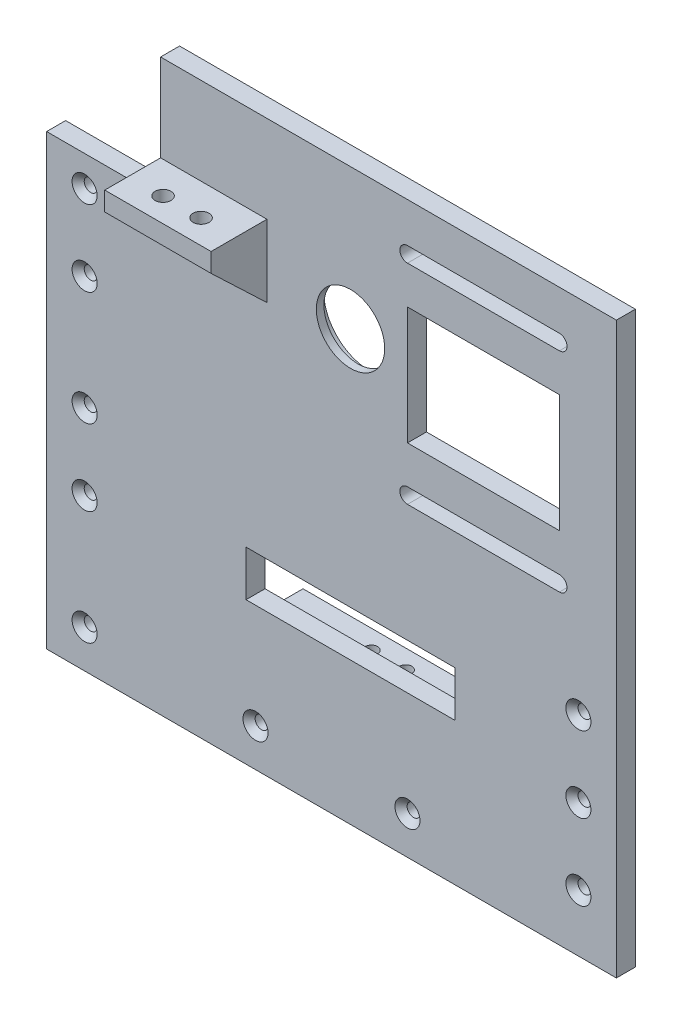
ISO-10303-21;
HEADER;
FILE_DESCRIPTION(('STEP AP214'),'2;1');
FILE_NAME('part.step','',(''),(''),'','','');
FILE_SCHEMA(('AUTOMOTIVE_DESIGN { 1 0 10303 214 1 1 1 1 }'));
ENDSEC;
DATA;
#1=APPLICATION_CONTEXT('core data for automotive mechanical design processes');
#2=APPLICATION_PROTOCOL_DEFINITION('international standard','automotive_design',2000,#1);
#3=PRODUCT_CONTEXT('',#1,'mechanical');
#4=PRODUCT('Part','Part','',(#3));
#5=PRODUCT_RELATED_PRODUCT_CATEGORY('part','',(#4));
#6=PRODUCT_DEFINITION_FORMATION('','',#4);
#7=PRODUCT_DEFINITION_CONTEXT('part definition',#1,'design');
#8=PRODUCT_DEFINITION('design','',#6,#7);
#9=PRODUCT_DEFINITION_SHAPE('','',#8);
#10=(LENGTH_UNIT() NAMED_UNIT(*) SI_UNIT(.MILLI.,.METRE.));
#11=(NAMED_UNIT(*) PLANE_ANGLE_UNIT() SI_UNIT($,.RADIAN.));
#12=(NAMED_UNIT(*) SI_UNIT($,.STERADIAN.) SOLID_ANGLE_UNIT());
#13=UNCERTAINTY_MEASURE_WITH_UNIT(LENGTH_MEASURE(1.E-05),#10,'distance_accuracy_value','');
#14=(GEOMETRIC_REPRESENTATION_CONTEXT(3) GLOBAL_UNCERTAINTY_ASSIGNED_CONTEXT((#13)) GLOBAL_UNIT_ASSIGNED_CONTEXT((#10,
#11,#12)) REPRESENTATION_CONTEXT('',''));
#15=CARTESIAN_POINT('',(0.,0.,0.));
#16=DIRECTION('',(0.,0.,1.));
#17=DIRECTION('',(1.,0.,0.));
#18=AXIS2_PLACEMENT_3D('',#15,#16,#17);
#19=CARTESIAN_POINT('',(0.,0.,5.));
#20=DIRECTION('',(0.,0.,1.));
#21=DIRECTION('',(1.,0.,0.));
#22=AXIS2_PLACEMENT_3D('',#19,#20,#21);
#23=PLANE('',#22);
#24=DIRECTION('',(0.,1.,0.));
#25=VECTOR('',#24,1.);
#26=CARTESIAN_POINT('',(32.5,0.,5.));
#27=LINE('',#26,#25);
#28=CARTESIAN_POINT('',(32.5,-37.5,5.));
#29=VERTEX_POINT('',#28);
#30=CARTESIAN_POINT('',(32.5,-25.5,5.));
#31=VERTEX_POINT('',#30);
#32=EDGE_CURVE('E11',#29,#31,#27,.T.);
#33=ORIENTED_EDGE('',*,*,#32,.F.);
#34=DIRECTION('',(1.,0.,0.));
#35=VECTOR('',#34,1.);
#36=CARTESIAN_POINT('',(0.,-37.5,5.));
#37=LINE('',#36,#35);
#38=CARTESIAN_POINT('',(-22.5,-37.5,5.));
#39=VERTEX_POINT('',#38);
#40=EDGE_CURVE('E808',#39,#29,#37,.T.);
#41=ORIENTED_EDGE('',*,*,#40,.F.);
#42=DIRECTION('',(0.,-1.,0.));
#43=VECTOR('',#42,1.);
#44=CARTESIAN_POINT('',(-22.5,0.,5.));
#45=LINE('',#44,#43);
#46=CARTESIAN_POINT('',(-22.5,-25.5,5.));
#47=VERTEX_POINT('',#46);
#48=EDGE_CURVE('E823',#47,#39,#45,.T.);
#49=ORIENTED_EDGE('',*,*,#48,.F.);
#50=DIRECTION('',(-1.,0.,0.));
#51=VECTOR('',#50,1.);
#52=CARTESIAN_POINT('',(0.,-25.5,5.));
#53=LINE('',#52,#51);
#54=EDGE_CURVE('E54',#31,#47,#53,.T.);
#55=ORIENTED_EDGE('',*,*,#54,.F.);
#56=EDGE_LOOP('',(#33,#41,#49,#55));
#57=FACE_BOUND('',#56,.T.);
#58=CARTESIAN_POINT('',(65.,-20.,5.));
#59=DIRECTION('',(0.,0.,1.));
#60=DIRECTION('',(1.,0.,0.));
#61=AXIS2_PLACEMENT_3D('',#58,#59,#60);
#62=CIRCLE('',#61,3.3);
#63=CARTESIAN_POINT('',(68.3,-20.,5.));
#64=VERTEX_POINT('',#63);
#65=EDGE_CURVE('E489',#64,#64,#62,.T.);
#66=ORIENTED_EDGE('',*,*,#65,.F.);
#67=EDGE_LOOP('',(#66));
#68=FACE_BOUND('',#67,.T.);
#69=CARTESIAN_POINT('',(65.,-40.,5.));
#70=DIRECTION('',(0.,0.,1.));
#71=DIRECTION('',(1.,0.,0.));
#72=AXIS2_PLACEMENT_3D('',#69,#70,#71);
#73=CIRCLE('',#72,3.3);
#74=CARTESIAN_POINT('',(68.3,-40.,5.));
#75=VERTEX_POINT('',#74);
#76=EDGE_CURVE('E498',#75,#75,#73,.T.);
#77=ORIENTED_EDGE('',*,*,#76,.F.);
#78=EDGE_LOOP('',(#77));
#79=FACE_BOUND('',#78,.T.);
#80=CARTESIAN_POINT('',(65.,-60.,5.));
#81=DIRECTION('',(0.,0.,1.));
#82=DIRECTION('',(1.,0.,0.));
#83=AXIS2_PLACEMENT_3D('',#80,#81,#82);
#84=CIRCLE('',#83,3.3);
#85=CARTESIAN_POINT('',(68.3,-60.,5.));
#86=VERTEX_POINT('',#85);
#87=EDGE_CURVE('E507',#86,#86,#84,.T.);
#88=ORIENTED_EDGE('',*,*,#87,.F.);
#89=EDGE_LOOP('',(#88));
#90=FACE_BOUND('',#89,.T.);
#91=CARTESIAN_POINT('',(20.,7.49999999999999,5.));
#92=DIRECTION('',(0.,0.,1.));
#93=DIRECTION('',(1.,0.,0.));
#94=AXIS2_PLACEMENT_3D('',#91,#92,#93);
#95=CIRCLE('',#94,2.);
#96=CARTESIAN_POINT('',(20.,9.49999999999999,5.));
#97=VERTEX_POINT('',#96);
#98=CARTESIAN_POINT('',(20.,5.49999999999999,5.));
#99=VERTEX_POINT('',#98);
#100=EDGE_CURVE('E530',#97,#99,#95,.T.);
#101=ORIENTED_EDGE('',*,*,#100,.F.);
#102=DIRECTION('',(-1.,0.,0.));
#103=VECTOR('',#102,1.);
#104=CARTESIAN_POINT('',(20.,9.49999999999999,5.));
#105=LINE('',#104,#103);
#106=CARTESIAN_POINT('',(60.,9.49999999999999,5.));
#107=VERTEX_POINT('',#106);
#108=EDGE_CURVE('E576',#107,#97,#105,.T.);
#109=ORIENTED_EDGE('',*,*,#108,.F.);
#110=CARTESIAN_POINT('',(60.,7.49999999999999,5.));
#111=DIRECTION('',(0.,0.,1.));
#112=DIRECTION('',(1.,0.,0.));
#113=AXIS2_PLACEMENT_3D('',#110,#111,#112);
#114=CIRCLE('',#113,2.);
#115=CARTESIAN_POINT('',(60.,5.49999999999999,5.));
#116=VERTEX_POINT('',#115);
#117=EDGE_CURVE('E580',#116,#107,#114,.T.);
#118=ORIENTED_EDGE('',*,*,#117,.F.);
#119=DIRECTION('',(1.,0.,0.));
#120=VECTOR('',#119,1.);
#121=CARTESIAN_POINT('',(20.,5.49999999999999,5.));
#122=LINE('',#121,#120);
#123=EDGE_CURVE('E585',#99,#116,#122,.T.);
#124=ORIENTED_EDGE('',*,*,#123,.F.);
#125=EDGE_LOOP('',(#101,#109,#118,#124));
#126=FACE_BOUND('',#125,.T.);
#127=CARTESIAN_POINT('',(20.,62.5,5.));
#128=DIRECTION('',(0.,0.,1.));
#129=DIRECTION('',(1.,0.,0.));
#130=AXIS2_PLACEMENT_3D('',#127,#128,#129);
#131=CIRCLE('',#130,2.00000000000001);
#132=CARTESIAN_POINT('',(20.,64.5,5.));
#133=VERTEX_POINT('',#132);
#134=CARTESIAN_POINT('',(20.,60.5,5.));
#135=VERTEX_POINT('',#134);
#136=EDGE_CURVE('E544',#133,#135,#131,.T.);
#137=ORIENTED_EDGE('',*,*,#136,.F.);
#138=DIRECTION('',(-1.,0.,0.));
#139=VECTOR('',#138,1.);
#140=CARTESIAN_POINT('',(20.,64.5,5.));
#141=LINE('',#140,#139);
#142=CARTESIAN_POINT('',(60.,64.5,5.));
#143=VERTEX_POINT('',#142);
#144=EDGE_CURVE('E531',#143,#133,#141,.T.);
#145=ORIENTED_EDGE('',*,*,#144,.F.);
#146=CARTESIAN_POINT('',(60.,62.5,5.));
#147=DIRECTION('',(0.,0.,1.));
#148=DIRECTION('',(1.,0.,0.));
#149=AXIS2_PLACEMENT_3D('',#146,#147,#148);
#150=CIRCLE('',#149,2.00000000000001);
#151=CARTESIAN_POINT('',(60.,60.5,5.));
#152=VERTEX_POINT('',#151);
#153=EDGE_CURVE('E535',#152,#143,#150,.T.);
#154=ORIENTED_EDGE('',*,*,#153,.F.);
#155=DIRECTION('',(1.,0.,0.));
#156=VECTOR('',#155,1.);
#157=CARTESIAN_POINT('',(20.,60.5,5.));
#158=LINE('',#157,#156);
#159=EDGE_CURVE('E540',#135,#152,#158,.T.);
#160=ORIENTED_EDGE('',*,*,#159,.F.);
#161=EDGE_LOOP('',(#137,#145,#154,#160));
#162=FACE_BOUND('',#161,.T.);
#163=DIRECTION('',(0.,1.,0.));
#164=VECTOR('',#163,1.);
#165=CARTESIAN_POINT('',(60.,50.5,5.));
#166=LINE('',#165,#164);
#167=CARTESIAN_POINT('',(60.,19.5,5.));
#168=VERTEX_POINT('',#167);
#169=CARTESIAN_POINT('',(60.,50.5,5.));
#170=VERTEX_POINT('',#169);
#171=EDGE_CURVE('E547',#168,#170,#166,.T.);
#172=ORIENTED_EDGE('',*,*,#171,.F.);
#173=DIRECTION('',(1.,0.,0.));
#174=VECTOR('',#173,1.);
#175=CARTESIAN_POINT('',(20.,19.5,5.));
#176=LINE('',#175,#174);
#177=CARTESIAN_POINT('',(20.,19.5,5.));
#178=VERTEX_POINT('',#177);
#179=EDGE_CURVE('E610',#178,#168,#176,.T.);
#180=ORIENTED_EDGE('',*,*,#179,.F.);
#181=DIRECTION('',(0.,-1.,0.));
#182=VECTOR('',#181,1.);
#183=CARTESIAN_POINT('',(20.,50.5,5.));
#184=LINE('',#183,#182);
#185=CARTESIAN_POINT('',(20.,50.5,5.));
#186=VERTEX_POINT('',#185);
#187=EDGE_CURVE('E629',#186,#178,#184,.T.);
#188=ORIENTED_EDGE('',*,*,#187,.F.);
#189=DIRECTION('',(-1.,0.,0.));
#190=VECTOR('',#189,1.);
#191=CARTESIAN_POINT('',(20.,50.5,5.));
#192=LINE('',#191,#190);
#193=EDGE_CURVE('E625',#170,#186,#192,.T.);
#194=ORIENTED_EDGE('',*,*,#193,.F.);
#195=EDGE_LOOP('',(#172,#180,#188,#194));
#196=FACE_BOUND('',#195,.T.);
#197=CARTESIAN_POINT('',(5.,38.,5.));
#198=DIRECTION('',(0.,0.,1.));
#199=DIRECTION('',(1.,0.,0.));
#200=AXIS2_PLACEMENT_3D('',#197,#198,#199);
#201=CIRCLE('',#200,9.);
#202=CARTESIAN_POINT('',(14.,38.,5.));
#203=VERTEX_POINT('',#202);
#204=EDGE_CURVE('E657',#203,#203,#201,.T.);
#205=ORIENTED_EDGE('',*,*,#204,.F.);
#206=EDGE_LOOP('',(#205));
#207=FACE_BOUND('',#206,.T.);
#208=CARTESIAN_POINT('',(-20.,-65.,5.));
#209=DIRECTION('',(0.,0.,1.));
#210=DIRECTION('',(1.,0.,0.));
#211=AXIS2_PLACEMENT_3D('',#208,#209,#210);
#212=CIRCLE('',#211,3.3);
#213=CARTESIAN_POINT('',(-16.7,-65.,5.));
#214=VERTEX_POINT('',#213);
#215=EDGE_CURVE('E672',#214,#214,#212,.T.);
#216=ORIENTED_EDGE('',*,*,#215,.F.);
#217=EDGE_LOOP('',(#216));
#218=FACE_BOUND('',#217,.T.);
#219=CARTESIAN_POINT('',(20.,-65.,5.));
#220=DIRECTION('',(0.,0.,1.));
#221=DIRECTION('',(1.,0.,0.));
#222=AXIS2_PLACEMENT_3D('',#219,#220,#221);
#223=CIRCLE('',#222,3.3);
#224=CARTESIAN_POINT('',(23.3,-65.,5.));
#225=VERTEX_POINT('',#224);
#226=EDGE_CURVE('E687',#225,#225,#223,.T.);
#227=ORIENTED_EDGE('',*,*,#226,.F.);
#228=EDGE_LOOP('',(#227));
#229=FACE_BOUND('',#228,.T.);
#230=CARTESIAN_POINT('',(-65.,35.,5.));
#231=DIRECTION('',(0.,0.,1.));
#232=DIRECTION('',(1.,0.,0.));
#233=AXIS2_PLACEMENT_3D('',#230,#231,#232);
#234=CIRCLE('',#233,3.3);
#235=CARTESIAN_POINT('',(-61.7,35.,5.));
#236=VERTEX_POINT('',#235);
#237=EDGE_CURVE('E696',#236,#236,#234,.T.);
#238=ORIENTED_EDGE('',*,*,#237,.F.);
#239=EDGE_LOOP('',(#238));
#240=FACE_BOUND('',#239,.T.);
#241=CARTESIAN_POINT('',(-65.,15.,5.));
#242=DIRECTION('',(0.,0.,1.));
#243=DIRECTION('',(1.,0.,0.));
#244=AXIS2_PLACEMENT_3D('',#241,#242,#243);
#245=CIRCLE('',#244,3.3);
#246=CARTESIAN_POINT('',(-61.7,15.,5.));
#247=VERTEX_POINT('',#246);
#248=EDGE_CURVE('E705',#247,#247,#245,.T.);
#249=ORIENTED_EDGE('',*,*,#248,.F.);
#250=EDGE_LOOP('',(#249));
#251=FACE_BOUND('',#250,.T.);
#252=CARTESIAN_POINT('',(-65.,-15.,5.));
#253=DIRECTION('',(0.,0.,1.));
#254=DIRECTION('',(1.,0.,0.));
#255=AXIS2_PLACEMENT_3D('',#252,#253,#254);
#256=CIRCLE('',#255,3.3);
#257=CARTESIAN_POINT('',(-61.7,-15.,5.));
#258=VERTEX_POINT('',#257);
#259=EDGE_CURVE('E714',#258,#258,#256,.T.);
#260=ORIENTED_EDGE('',*,*,#259,.F.);
#261=EDGE_LOOP('',(#260));
#262=FACE_BOUND('',#261,.T.);
#263=CARTESIAN_POINT('',(-65.,-35.,5.));
#264=DIRECTION('',(0.,0.,1.));
#265=DIRECTION('',(1.,0.,0.));
#266=AXIS2_PLACEMENT_3D('',#263,#264,#265);
#267=CIRCLE('',#266,3.3);
#268=CARTESIAN_POINT('',(-61.7,-35.,5.));
#269=VERTEX_POINT('',#268);
#270=EDGE_CURVE('E723',#269,#269,#267,.T.);
#271=ORIENTED_EDGE('',*,*,#270,.F.);
#272=EDGE_LOOP('',(#271));
#273=FACE_BOUND('',#272,.T.);
#274=CARTESIAN_POINT('',(-65.,-65.,5.));
#275=DIRECTION('',(0.,0.,1.));
#276=DIRECTION('',(1.,0.,0.));
#277=AXIS2_PLACEMENT_3D('',#274,#275,#276);
#278=CIRCLE('',#277,3.3);
#279=CARTESIAN_POINT('',(-61.7,-65.,5.));
#280=VERTEX_POINT('',#279);
#281=EDGE_CURVE('E732',#280,#280,#278,.T.);
#282=ORIENTED_EDGE('',*,*,#281,.F.);
#283=EDGE_LOOP('',(#282));
#284=FACE_BOUND('',#283,.T.);
#285=DIRECTION('',(1.,0.,0.));
#286=VECTOR('',#285,1.);
#287=CARTESIAN_POINT('',(-21.,33.,5.));
#288=LINE('',#287,#286);
#289=CARTESIAN_POINT('',(-21.,33.,5.));
#290=VERTEX_POINT('',#289);
#291=CARTESIAN_POINT('',(-17.,33.,5.));
#292=VERTEX_POINT('',#291);
#293=EDGE_CURVE('E294',#290,#292,#288,.T.);
#294=ORIENTED_EDGE('',*,*,#293,.F.);
#295=DIRECTION('',(0.,1.,0.));
#296=VECTOR('',#295,1.);
#297=CARTESIAN_POINT('',(-21.,47.,5.));
#298=LINE('',#297,#296);
#299=CARTESIAN_POINT('',(-21.,47.,5.));
#300=VERTEX_POINT('',#299);
#301=EDGE_CURVE('E279',#290,#300,#298,.T.);
#302=ORIENTED_EDGE('',*,*,#301,.T.);
#303=DIRECTION('',(1.,0.,0.));
#304=VECTOR('',#303,1.);
#305=CARTESIAN_POINT('',(-45.,47.,5.));
#306=LINE('',#305,#304);
#307=CARTESIAN_POINT('',(-41.,47.,5.));
#308=VERTEX_POINT('',#307);
#309=EDGE_CURVE('E333',#308,#300,#306,.T.);
#310=ORIENTED_EDGE('',*,*,#309,.F.);
#311=DIRECTION('',(0.,-1.,0.));
#312=VECTOR('',#311,1.);
#313=CARTESIAN_POINT('',(-41.,47.,5.));
#314=LINE('',#313,#312);
#315=CARTESIAN_POINT('',(-41.,33.,5.));
#316=VERTEX_POINT('',#315);
#317=EDGE_CURVE('E320',#308,#316,#314,.T.);
#318=ORIENTED_EDGE('',*,*,#317,.T.);
#319=DIRECTION('',(-1.,0.,0.));
#320=VECTOR('',#319,1.);
#321=CARTESIAN_POINT('',(-41.,33.,5.));
#322=LINE('',#321,#320);
#323=CARTESIAN_POINT('',(-45.,33.,5.));
#324=VERTEX_POINT('',#323);
#325=EDGE_CURVE('E324',#316,#324,#322,.T.);
#326=ORIENTED_EDGE('',*,*,#325,.T.);
#327=DIRECTION('',(0.,-1.,0.));
#328=VECTOR('',#327,1.);
#329=CARTESIAN_POINT('',(-45.,47.,5.));
#330=LINE('',#329,#328);
#331=CARTESIAN_POINT('',(-45.,43.,5.));
#332=VERTEX_POINT('',#331);
#333=EDGE_CURVE('E316',#332,#324,#330,.T.);
#334=ORIENTED_EDGE('',*,*,#333,.F.);
#335=DIRECTION('',(1.,0.,0.));
#336=VECTOR('',#335,1.);
#337=CARTESIAN_POINT('',(-75.,43.,5.));
#338=LINE('',#337,#336);
#339=CARTESIAN_POINT('',(-75.,43.,5.));
#340=VERTEX_POINT('',#339);
#341=EDGE_CURVE('E661',#340,#332,#338,.T.);
#342=ORIENTED_EDGE('',*,*,#341,.F.);
#343=DIRECTION('',(0.,-1.,0.));
#344=VECTOR('',#343,1.);
#345=CARTESIAN_POINT('',(-75.,75.,5.));
#346=LINE('',#345,#344);
#347=CARTESIAN_POINT('',(-75.,-75.,5.));
#348=VERTEX_POINT('',#347);
#349=EDGE_CURVE('E750',#340,#348,#346,.T.);
#350=ORIENTED_EDGE('',*,*,#349,.T.);
#351=DIRECTION('',(1.,0.,0.));
#352=VECTOR('',#351,1.);
#353=CARTESIAN_POINT('',(-75.,-75.,5.));
#354=LINE('',#353,#352);
#355=CARTESIAN_POINT('',(75.,-75.,5.));
#356=VERTEX_POINT('',#355);
#357=EDGE_CURVE('E753',#348,#356,#354,.T.);
#358=ORIENTED_EDGE('',*,*,#357,.T.);
#359=DIRECTION('',(0.,1.,0.));
#360=VECTOR('',#359,1.);
#361=CARTESIAN_POINT('',(75.,75.,5.));
#362=LINE('',#361,#360);
#363=CARTESIAN_POINT('',(75.,75.,5.));
#364=VERTEX_POINT('',#363);
#365=EDGE_CURVE('E741',#356,#364,#362,.T.);
#366=ORIENTED_EDGE('',*,*,#365,.T.);
#367=DIRECTION('',(-1.,0.,0.));
#368=VECTOR('',#367,1.);
#369=CARTESIAN_POINT('',(-75.,75.,5.));
#370=LINE('',#369,#368);
#371=CARTESIAN_POINT('',(-45.,75.,5.));
#372=VERTEX_POINT('',#371);
#373=EDGE_CURVE('E745',#364,#372,#370,.T.);
#374=ORIENTED_EDGE('',*,*,#373,.T.);
#375=DIRECTION('',(0.,1.,0.));
#376=VECTOR('',#375,1.);
#377=CARTESIAN_POINT('',(-45.,75.,5.));
#378=LINE('',#377,#376);
#379=CARTESIAN_POINT('',(-45.,52.,5.));
#380=VERTEX_POINT('',#379);
#381=EDGE_CURVE('E665',#380,#372,#378,.T.);
#382=ORIENTED_EDGE('',*,*,#381,.F.);
#383=DIRECTION('',(-1.,0.,0.));
#384=VECTOR('',#383,1.);
#385=CARTESIAN_POINT('',(-45.,52.,5.));
#386=LINE('',#385,#384);
#387=CARTESIAN_POINT('',(-17.,52.,5.));
#388=VERTEX_POINT('',#387);
#389=EDGE_CURVE('E339',#388,#380,#386,.T.);
#390=ORIENTED_EDGE('',*,*,#389,.F.);
#391=DIRECTION('',(0.,1.,0.));
#392=VECTOR('',#391,1.);
#393=CARTESIAN_POINT('',(-17.,52.,5.));
#394=LINE('',#393,#392);
#395=EDGE_CURVE('E302',#292,#388,#394,.T.);
#396=ORIENTED_EDGE('',*,*,#395,.F.);
#397=EDGE_LOOP('',(#294,#302,#310,#318,#326,#334,#342,#350,#358,#366,#374,#382,#390,#396));
#398=FACE_BOUND('',#397,.T.);
#399=ADVANCED_FACE('F45',(#57,#68,#79,#90,#126,#162,#196,#207,#218,#229,#240,#251,#262,#273,
#284,#398),#23,.T.);
#400=CARTESIAN_POINT('',(-45.,47.,19.7));
#401=DIRECTION('',(0.,1.,0.));
#402=DIRECTION('',(0.,0.,1.));
#403=AXIS2_PLACEMENT_3D('',#400,#401,#402);
#404=PLANE('',#403);
#405=CARTESIAN_POINT('',(-36.,47.,13.35));
#406=DIRECTION('',(0.,1.,0.));
#407=DIRECTION('',(0.,0.,1.));
#408=AXIS2_PLACEMENT_3D('',#405,#406,#407);
#409=CIRCLE('',#408,2.09999999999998);
#410=CARTESIAN_POINT('',(-36.,47.,15.45));
#411=VERTEX_POINT('',#410);
#412=EDGE_CURVE('E917',#411,#411,#409,.T.);
#413=ORIENTED_EDGE('',*,*,#412,.T.);
#414=EDGE_LOOP('',(#413));
#415=FACE_BOUND('',#414,.T.);
#416=CARTESIAN_POINT('',(-26.,47.,13.35));
#417=DIRECTION('',(0.,1.,0.));
#418=DIRECTION('',(0.,0.,1.));
#419=AXIS2_PLACEMENT_3D('',#416,#417,#418);
#420=CIRCLE('',#419,2.09999999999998);
#421=CARTESIAN_POINT('',(-26.,47.,15.45));
#422=VERTEX_POINT('',#421);
#423=EDGE_CURVE('E916',#422,#422,#420,.T.);
#424=ORIENTED_EDGE('',*,*,#423,.T.);
#425=EDGE_LOOP('',(#424));
#426=FACE_BOUND('',#425,.T.);
#427=DIRECTION('',(0.,0.,1.));
#428=VECTOR('',#427,1.);
#429=CARTESIAN_POINT('',(-21.,47.,19.7));
#430=LINE('',#429,#428);
#431=CARTESIAN_POINT('',(-21.,47.,19.7));
#432=VERTEX_POINT('',#431);
#433=EDGE_CURVE('E284',#300,#432,#430,.T.);
#434=ORIENTED_EDGE('',*,*,#433,.T.);
#435=DIRECTION('',(1.,0.,0.));
#436=VECTOR('',#435,1.);
#437=CARTESIAN_POINT('',(-45.,47.,19.7));
#438=LINE('',#437,#436);
#439=CARTESIAN_POINT('',(-41.,47.,19.7));
#440=VERTEX_POINT('',#439);
#441=EDGE_CURVE('E338',#440,#432,#438,.T.);
#442=ORIENTED_EDGE('',*,*,#441,.F.);
#443=DIRECTION('',(0.,0.,-1.));
#444=VECTOR('',#443,1.);
#445=CARTESIAN_POINT('',(-41.,47.,19.7));
#446=LINE('',#445,#444);
#447=EDGE_CURVE('E315',#440,#308,#446,.T.);
#448=ORIENTED_EDGE('',*,*,#447,.T.);
#449=ORIENTED_EDGE('',*,*,#309,.T.);
#450=EDGE_LOOP('',(#434,#442,#448,#449));
#451=FACE_BOUND('',#450,.T.);
#452=ADVANCED_FACE('F980',(#415,#426,#451),#404,.F.);
#453=CARTESIAN_POINT('',(-45.,52.,19.7));
#454=DIRECTION('',(1.,0.,0.));
#455=DIRECTION('',(0.,0.,-1.));
#456=AXIS2_PLACEMENT_3D('',#453,#454,#455);
#457=PLANE('',#456);
#458=DIRECTION('',(0.,1.,0.));
#459=VECTOR('',#458,1.);
#460=CARTESIAN_POINT('',(-45.,0.,0.));
#461=LINE('',#460,#459);
#462=CARTESIAN_POINT('',(-45.,43.,0.));
#463=VERTEX_POINT('',#462);
#464=CARTESIAN_POINT('',(-45.,75.,0.));
#465=VERTEX_POINT('',#464);
#466=EDGE_CURVE('E805',#463,#465,#461,.T.);
#467=ORIENTED_EDGE('',*,*,#466,.F.);
#468=DIRECTION('',(0.,0.,1.));
#469=VECTOR('',#468,1.);
#470=CARTESIAN_POINT('',(-45.,43.,-5.));
#471=LINE('',#470,#469);
#472=EDGE_CURVE('E673',#463,#332,#471,.T.);
#473=ORIENTED_EDGE('',*,*,#472,.T.);
#474=ORIENTED_EDGE('',*,*,#333,.T.);
#475=DIRECTION('',(0.,0.689655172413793,0.724137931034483));
#476=VECTOR('',#475,1.);
#477=CARTESIAN_POINT('',(-45.,33.,5.));
#478=LINE('',#477,#476);
#479=CARTESIAN_POINT('',(-45.,47.,19.7));
#480=VERTEX_POINT('',#479);
#481=EDGE_CURVE('E307',#324,#480,#478,.T.);
#482=ORIENTED_EDGE('',*,*,#481,.T.);
#483=DIRECTION('',(0.,-1.,0.));
#484=VECTOR('',#483,1.);
#485=CARTESIAN_POINT('',(-45.,52.,19.7));
#486=LINE('',#485,#484);
#487=CARTESIAN_POINT('',(-45.,52.,19.7));
#488=VERTEX_POINT('',#487);
#489=EDGE_CURVE('E334',#488,#480,#486,.T.);
#490=ORIENTED_EDGE('',*,*,#489,.F.);
#491=DIRECTION('',(0.,0.,-1.));
#492=VECTOR('',#491,1.);
#493=CARTESIAN_POINT('',(-45.,52.,19.7));
#494=LINE('',#493,#492);
#495=EDGE_CURVE('E350',#488,#380,#494,.T.);
#496=ORIENTED_EDGE('',*,*,#495,.T.);
#497=ORIENTED_EDGE('',*,*,#381,.T.);
#498=DIRECTION('',(0.,0.,1.));
#499=VECTOR('',#498,1.);
#500=CARTESIAN_POINT('',(-45.,75.,-5.));
#501=LINE('',#500,#499);
#502=EDGE_CURVE('E668',#465,#372,#501,.T.);
#503=ORIENTED_EDGE('',*,*,#502,.F.);
#504=EDGE_LOOP('',(#467,#473,#474,#482,#490,#496,#497,#503));
#505=FACE_BOUND('',#504,.T.);
#506=ADVANCED_FACE('F853',(#505),#457,.F.);
#507=CARTESIAN_POINT('',(0.,0.,0.));
#508=DIRECTION('',(0.,0.,1.));
#509=DIRECTION('',(1.,0.,0.));
#510=AXIS2_PLACEMENT_3D('',#507,#508,#509);
#511=PLANE('',#510);
#512=ORIENTED_EDGE('',*,*,#466,.T.);
#513=DIRECTION('',(-1.,0.,0.));
#514=VECTOR('',#513,1.);
#515=CARTESIAN_POINT('',(-75.,75.,0.));
#516=LINE('',#515,#514);
#517=CARTESIAN_POINT('',(75.,75.,0.));
#518=VERTEX_POINT('',#517);
#519=EDGE_CURVE('E761',#518,#465,#516,.T.);
#520=ORIENTED_EDGE('',*,*,#519,.F.);
#521=DIRECTION('',(0.,1.,0.));
#522=VECTOR('',#521,1.);
#523=CARTESIAN_POINT('',(75.,75.,0.));
#524=LINE('',#523,#522);
#525=CARTESIAN_POINT('',(75.,-75.,0.));
#526=VERTEX_POINT('',#525);
#527=EDGE_CURVE('E757',#526,#518,#524,.T.);
#528=ORIENTED_EDGE('',*,*,#527,.F.);
#529=DIRECTION('',(1.,0.,0.));
#530=VECTOR('',#529,1.);
#531=CARTESIAN_POINT('',(-75.,-75.,0.));
#532=LINE('',#531,#530);
#533=CARTESIAN_POINT('',(-75.,-75.,0.));
#534=VERTEX_POINT('',#533);
#535=EDGE_CURVE('E746',#534,#526,#532,.T.);
#536=ORIENTED_EDGE('',*,*,#535,.F.);
#537=DIRECTION('',(0.,-1.,0.));
#538=VECTOR('',#537,1.);
#539=CARTESIAN_POINT('',(-75.,75.,0.));
#540=LINE('',#539,#538);
#541=CARTESIAN_POINT('',(-75.,43.,0.));
#542=VERTEX_POINT('',#541);
#543=EDGE_CURVE('E765',#542,#534,#540,.T.);
#544=ORIENTED_EDGE('',*,*,#543,.F.);
#545=DIRECTION('',(1.,0.,0.));
#546=VECTOR('',#545,1.);
#547=CARTESIAN_POINT('',(0.,43.,0.));
#548=LINE('',#547,#546);
#549=EDGE_CURVE('E781',#542,#463,#548,.T.);
#550=ORIENTED_EDGE('',*,*,#549,.T.);
#551=EDGE_LOOP('',(#512,#520,#528,#536,#544,#550));
#552=FACE_BOUND('',#551,.T.);
#553=DIRECTION('',(-1.,0.,0.));
#554=VECTOR('',#553,1.);
#555=CARTESIAN_POINT('',(32.5,-37.5,0.));
#556=LINE('',#555,#554);
#557=CARTESIAN_POINT('',(32.5,-37.5,0.));
#558=VERTEX_POINT('',#557);
#559=CARTESIAN_POINT('',(-22.5,-37.5,0.));
#560=VERTEX_POINT('',#559);
#561=EDGE_CURVE('E381',#558,#560,#556,.T.);
#562=ORIENTED_EDGE('',*,*,#561,.F.);
#563=DIRECTION('',(0.,-1.,0.));
#564=VECTOR('',#563,1.);
#565=CARTESIAN_POINT('',(32.5,-25.5,0.));
#566=LINE('',#565,#564);
#567=CARTESIAN_POINT('',(32.5,-25.5,0.));
#568=VERTEX_POINT('',#567);
#569=EDGE_CURVE('E378',#568,#558,#566,.T.);
#570=ORIENTED_EDGE('',*,*,#569,.F.);
#571=DIRECTION('',(1.,0.,0.));
#572=VECTOR('',#571,1.);
#573=CARTESIAN_POINT('',(32.5,-25.5,0.));
#574=LINE('',#573,#572);
#575=CARTESIAN_POINT('',(-22.5,-25.5,0.));
#576=VERTEX_POINT('',#575);
#577=EDGE_CURVE('E389',#576,#568,#574,.T.);
#578=ORIENTED_EDGE('',*,*,#577,.F.);
#579=DIRECTION('',(0.,1.,0.));
#580=VECTOR('',#579,1.);
#581=CARTESIAN_POINT('',(-22.5,-25.5,0.));
#582=LINE('',#581,#580);
#583=EDGE_CURVE('E385',#560,#576,#582,.T.);
#584=ORIENTED_EDGE('',*,*,#583,.F.);
#585=EDGE_LOOP('',(#562,#570,#578,#584));
#586=FACE_BOUND('',#585,.T.);
#587=CARTESIAN_POINT('',(-65.,-65.,0.));
#588=DIRECTION('',(0.,0.,1.));
#589=DIRECTION('',(1.,0.,0.));
#590=AXIS2_PLACEMENT_3D('',#587,#588,#589);
#591=CIRCLE('',#590,1.69999999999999);
#592=CARTESIAN_POINT('',(-63.3,-65.,0.));
#593=VERTEX_POINT('',#592);
#594=EDGE_CURVE('E740',#593,#593,#591,.T.);
#595=ORIENTED_EDGE('',*,*,#594,.T.);
#596=EDGE_LOOP('',(#595));
#597=FACE_BOUND('',#596,.T.);
#598=CARTESIAN_POINT('',(-65.,-35.,0.));
#599=DIRECTION('',(0.,0.,1.));
#600=DIRECTION('',(1.,0.,0.));
#601=AXIS2_PLACEMENT_3D('',#598,#599,#600);
#602=CIRCLE('',#601,1.69999999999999);
#603=CARTESIAN_POINT('',(-63.3,-35.,0.));
#604=VERTEX_POINT('',#603);
#605=EDGE_CURVE('E731',#604,#604,#602,.T.);
#606=ORIENTED_EDGE('',*,*,#605,.T.);
#607=EDGE_LOOP('',(#606));
#608=FACE_BOUND('',#607,.T.);
#609=CARTESIAN_POINT('',(-65.,-15.,0.));
#610=DIRECTION('',(0.,0.,1.));
#611=DIRECTION('',(1.,0.,0.));
#612=AXIS2_PLACEMENT_3D('',#609,#610,#611);
#613=CIRCLE('',#612,1.69999999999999);
#614=CARTESIAN_POINT('',(-63.3,-15.,0.));
#615=VERTEX_POINT('',#614);
#616=EDGE_CURVE('E722',#615,#615,#613,.T.);
#617=ORIENTED_EDGE('',*,*,#616,.T.);
#618=EDGE_LOOP('',(#617));
#619=FACE_BOUND('',#618,.T.);
#620=CARTESIAN_POINT('',(-65.,15.,0.));
#621=DIRECTION('',(0.,0.,1.));
#622=DIRECTION('',(1.,0.,0.));
#623=AXIS2_PLACEMENT_3D('',#620,#621,#622);
#624=CIRCLE('',#623,1.69999999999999);
#625=CARTESIAN_POINT('',(-63.3,15.,0.));
#626=VERTEX_POINT('',#625);
#627=EDGE_CURVE('E713',#626,#626,#624,.T.);
#628=ORIENTED_EDGE('',*,*,#627,.T.);
#629=EDGE_LOOP('',(#628));
#630=FACE_BOUND('',#629,.T.);
#631=CARTESIAN_POINT('',(-65.,35.,0.));
#632=DIRECTION('',(0.,0.,1.));
#633=DIRECTION('',(1.,0.,0.));
#634=AXIS2_PLACEMENT_3D('',#631,#632,#633);
#635=CIRCLE('',#634,1.69999999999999);
#636=CARTESIAN_POINT('',(-63.3,35.,0.));
#637=VERTEX_POINT('',#636);
#638=EDGE_CURVE('E704',#637,#637,#635,.T.);
#639=ORIENTED_EDGE('',*,*,#638,.T.);
#640=EDGE_LOOP('',(#639));
#641=FACE_BOUND('',#640,.T.);
#642=CARTESIAN_POINT('',(20.,-65.,0.));
#643=DIRECTION('',(0.,0.,1.));
#644=DIRECTION('',(1.,0.,0.));
#645=AXIS2_PLACEMENT_3D('',#642,#643,#644);
#646=CIRCLE('',#645,1.69999999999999);
#647=CARTESIAN_POINT('',(21.7,-65.,0.));
#648=VERTEX_POINT('',#647);
#649=EDGE_CURVE('E695',#648,#648,#646,.T.);
#650=ORIENTED_EDGE('',*,*,#649,.T.);
#651=EDGE_LOOP('',(#650));
#652=FACE_BOUND('',#651,.T.);
#653=CARTESIAN_POINT('',(-20.,-65.,0.));
#654=DIRECTION('',(0.,0.,1.));
#655=DIRECTION('',(1.,0.,0.));
#656=AXIS2_PLACEMENT_3D('',#653,#654,#655);
#657=CIRCLE('',#656,1.69999999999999);
#658=CARTESIAN_POINT('',(-18.3,-65.,0.));
#659=VERTEX_POINT('',#658);
#660=EDGE_CURVE('E686',#659,#659,#657,.T.);
#661=ORIENTED_EDGE('',*,*,#660,.T.);
#662=EDGE_LOOP('',(#661));
#663=FACE_BOUND('',#662,.T.);
#664=CARTESIAN_POINT('',(5.,38.,0.));
#665=DIRECTION('',(0.,0.,-1.));
#666=DIRECTION('',(-1.,0.,0.));
#667=AXIS2_PLACEMENT_3D('',#664,#665,#666);
#668=CIRCLE('',#667,12.05);
#669=CARTESIAN_POINT('',(-7.04999999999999,38.,0.));
#670=VERTEX_POINT('',#669);
#671=EDGE_CURVE('E639',#670,#670,#668,.T.);
#672=ORIENTED_EDGE('',*,*,#671,.F.);
#673=EDGE_LOOP('',(#672));
#674=FACE_BOUND('',#673,.T.);
#675=DIRECTION('',(1.,0.,0.));
#676=VECTOR('',#675,1.);
#677=CARTESIAN_POINT('',(20.,19.5,0.));
#678=LINE('',#677,#676);
#679=CARTESIAN_POINT('',(20.,19.5,0.));
#680=VERTEX_POINT('',#679);
#681=CARTESIAN_POINT('',(60.,19.5,0.));
#682=VERTEX_POINT('',#681);
#683=EDGE_CURVE('E618',#680,#682,#678,.T.);
#684=ORIENTED_EDGE('',*,*,#683,.T.);
#685=DIRECTION('',(0.,1.,0.));
#686=VECTOR('',#685,1.);
#687=CARTESIAN_POINT('',(60.,50.5,0.));
#688=LINE('',#687,#686);
#689=CARTESIAN_POINT('',(60.,50.5,0.));
#690=VERTEX_POINT('',#689);
#691=EDGE_CURVE('E605',#682,#690,#688,.T.);
#692=ORIENTED_EDGE('',*,*,#691,.T.);
#693=DIRECTION('',(-1.,0.,0.));
#694=VECTOR('',#693,1.);
#695=CARTESIAN_POINT('',(20.,50.5,0.));
#696=LINE('',#695,#694);
#697=CARTESIAN_POINT('',(20.,50.5,0.));
#698=VERTEX_POINT('',#697);
#699=EDGE_CURVE('E609',#690,#698,#696,.T.);
#700=ORIENTED_EDGE('',*,*,#699,.T.);
#701=DIRECTION('',(0.,-1.,0.));
#702=VECTOR('',#701,1.);
#703=CARTESIAN_POINT('',(20.,50.5,0.));
#704=LINE('',#703,#702);
#705=EDGE_CURVE('E614',#698,#680,#704,.T.);
#706=ORIENTED_EDGE('',*,*,#705,.T.);
#707=EDGE_LOOP('',(#684,#692,#700,#706));
#708=FACE_BOUND('',#707,.T.);
#709=DIRECTION('',(-1.,0.,0.));
#710=VECTOR('',#709,1.);
#711=CARTESIAN_POINT('',(20.,64.5,0.));
#712=LINE('',#711,#710);
#713=CARTESIAN_POINT('',(60.,64.5,0.));
#714=VERTEX_POINT('',#713);
#715=CARTESIAN_POINT('',(20.,64.5,0.));
#716=VERTEX_POINT('',#715);
#717=EDGE_CURVE('E520',#714,#716,#712,.T.);
#718=ORIENTED_EDGE('',*,*,#717,.T.);
#719=CARTESIAN_POINT('',(20.,62.5,0.));
#720=DIRECTION('',(0.,0.,1.));
#721=DIRECTION('',(1.,0.,0.));
#722=AXIS2_PLACEMENT_3D('',#719,#720,#721);
#723=CIRCLE('',#722,2.00000000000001);
#724=CARTESIAN_POINT('',(20.,60.5,0.));
#725=VERTEX_POINT('',#724);
#726=EDGE_CURVE('E536',#716,#725,#723,.T.);
#727=ORIENTED_EDGE('',*,*,#726,.T.);
#728=DIRECTION('',(1.,0.,0.));
#729=VECTOR('',#728,1.);
#730=CARTESIAN_POINT('',(20.,60.5,0.));
#731=LINE('',#730,#729);
#732=CARTESIAN_POINT('',(60.,60.5,0.));
#733=VERTEX_POINT('',#732);
#734=EDGE_CURVE('E555',#725,#733,#731,.T.);
#735=ORIENTED_EDGE('',*,*,#734,.T.);
#736=CARTESIAN_POINT('',(60.,62.5,0.));
#737=DIRECTION('',(0.,0.,1.));
#738=DIRECTION('',(1.,0.,0.));
#739=AXIS2_PLACEMENT_3D('',#736,#737,#738);
#740=CIRCLE('',#739,2.00000000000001);
#741=EDGE_CURVE('E551',#733,#714,#740,.T.);
#742=ORIENTED_EDGE('',*,*,#741,.T.);
#743=EDGE_LOOP('',(#718,#727,#735,#742));
#744=FACE_BOUND('',#743,.T.);
#745=DIRECTION('',(-1.,0.,0.));
#746=VECTOR('',#745,1.);
#747=CARTESIAN_POINT('',(20.,9.49999999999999,0.));
#748=LINE('',#747,#746);
#749=CARTESIAN_POINT('',(60.,9.49999999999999,0.));
#750=VERTEX_POINT('',#749);
#751=CARTESIAN_POINT('',(20.,9.49999999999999,0.));
#752=VERTEX_POINT('',#751);
#753=EDGE_CURVE('E566',#750,#752,#748,.T.);
#754=ORIENTED_EDGE('',*,*,#753,.T.);
#755=CARTESIAN_POINT('',(20.,7.49999999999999,0.));
#756=DIRECTION('',(0.,0.,1.));
#757=DIRECTION('',(1.,0.,0.));
#758=AXIS2_PLACEMENT_3D('',#755,#756,#757);
#759=CIRCLE('',#758,2.);
#760=CARTESIAN_POINT('',(20.,5.49999999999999,0.));
#761=VERTEX_POINT('',#760);
#762=EDGE_CURVE('E581',#752,#761,#759,.T.);
#763=ORIENTED_EDGE('',*,*,#762,.T.);
#764=DIRECTION('',(1.,0.,0.));
#765=VECTOR('',#764,1.);
#766=CARTESIAN_POINT('',(20.,5.49999999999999,0.));
#767=LINE('',#766,#765);
#768=CARTESIAN_POINT('',(60.,5.49999999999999,0.));
#769=VERTEX_POINT('',#768);
#770=EDGE_CURVE('E598',#761,#769,#767,.T.);
#771=ORIENTED_EDGE('',*,*,#770,.T.);
#772=CARTESIAN_POINT('',(60.,7.49999999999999,0.));
#773=DIRECTION('',(0.,0.,1.));
#774=DIRECTION('',(1.,0.,0.));
#775=AXIS2_PLACEMENT_3D('',#772,#773,#774);
#776=CIRCLE('',#775,2.);
#777=EDGE_CURVE('E594',#769,#750,#776,.T.);
#778=ORIENTED_EDGE('',*,*,#777,.T.);
#779=EDGE_LOOP('',(#754,#763,#771,#778));
#780=FACE_BOUND('',#779,.T.);
#781=CARTESIAN_POINT('',(65.,-60.,0.));
#782=DIRECTION('',(0.,0.,1.));
#783=DIRECTION('',(1.,0.,0.));
#784=AXIS2_PLACEMENT_3D('',#781,#782,#783);
#785=CIRCLE('',#784,1.69999999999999);
#786=CARTESIAN_POINT('',(66.7,-60.,0.));
#787=VERTEX_POINT('',#786);
#788=EDGE_CURVE('E515',#787,#787,#785,.T.);
#789=ORIENTED_EDGE('',*,*,#788,.T.);
#790=EDGE_LOOP('',(#789));
#791=FACE_BOUND('',#790,.T.);
#792=CARTESIAN_POINT('',(65.,-40.,0.));
#793=DIRECTION('',(0.,0.,1.));
#794=DIRECTION('',(1.,0.,0.));
#795=AXIS2_PLACEMENT_3D('',#792,#793,#794);
#796=CIRCLE('',#795,1.69999999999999);
#797=CARTESIAN_POINT('',(66.7,-40.,0.));
#798=VERTEX_POINT('',#797);
#799=EDGE_CURVE('E506',#798,#798,#796,.T.);
#800=ORIENTED_EDGE('',*,*,#799,.T.);
#801=EDGE_LOOP('',(#800));
#802=FACE_BOUND('',#801,.T.);
#803=CARTESIAN_POINT('',(65.,-20.,0.));
#804=DIRECTION('',(0.,0.,1.));
#805=DIRECTION('',(1.,0.,0.));
#806=AXIS2_PLACEMENT_3D('',#803,#804,#805);
#807=CIRCLE('',#806,1.69999999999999);
#808=CARTESIAN_POINT('',(66.7,-20.,0.));
#809=VERTEX_POINT('',#808);
#810=EDGE_CURVE('E497',#809,#809,#807,.T.);
#811=ORIENTED_EDGE('',*,*,#810,.T.);
#812=EDGE_LOOP('',(#811));
#813=FACE_BOUND('',#812,.T.);
#814=DIRECTION('',(1.,0.,0.));
#815=VECTOR('',#814,1.);
#816=CARTESIAN_POINT('',(-22.5,-47.5,0.));
#817=LINE('',#816,#815);
#818=CARTESIAN_POINT('',(-17.5,-47.5,0.));
#819=VERTEX_POINT('',#818);
#820=CARTESIAN_POINT('',(27.5,-47.5,0.));
#821=VERTEX_POINT('',#820);
#822=EDGE_CURVE('E473',#819,#821,#817,.T.);
#823=ORIENTED_EDGE('',*,*,#822,.T.);
#824=DIRECTION('',(0.,1.,0.));
#825=VECTOR('',#824,1.);
#826=CARTESIAN_POINT('',(27.5,-47.5,0.));
#827=LINE('',#826,#825);
#828=CARTESIAN_POINT('',(27.5,-57.5,0.));
#829=VERTEX_POINT('',#828);
#830=EDGE_CURVE('E415',#829,#821,#827,.T.);
#831=ORIENTED_EDGE('',*,*,#830,.F.);
#832=DIRECTION('',(1.,0.,0.));
#833=VECTOR('',#832,1.);
#834=CARTESIAN_POINT('',(27.5,-57.5,0.));
#835=LINE('',#834,#833);
#836=CARTESIAN_POINT('',(32.5,-57.5,0.));
#837=VERTEX_POINT('',#836);
#838=EDGE_CURVE('E423',#829,#837,#835,.T.);
#839=ORIENTED_EDGE('',*,*,#838,.T.);
#840=DIRECTION('',(0.,1.,0.));
#841=VECTOR('',#840,1.);
#842=CARTESIAN_POINT('',(32.5,-42.5,0.));
#843=LINE('',#842,#841);
#844=CARTESIAN_POINT('',(32.5,-42.5,0.));
#845=VERTEX_POINT('',#844);
#846=EDGE_CURVE('E450',#837,#845,#843,.T.);
#847=ORIENTED_EDGE('',*,*,#846,.T.);
#848=DIRECTION('',(-1.,0.,0.));
#849=VECTOR('',#848,1.);
#850=CARTESIAN_POINT('',(-22.5,-42.5,0.));
#851=LINE('',#850,#849);
#852=CARTESIAN_POINT('',(-22.5,-42.5,0.));
#853=VERTEX_POINT('',#852);
#854=EDGE_CURVE('E456',#845,#853,#851,.T.);
#855=ORIENTED_EDGE('',*,*,#854,.T.);
#856=DIRECTION('',(0.,-1.,0.));
#857=VECTOR('',#856,1.);
#858=CARTESIAN_POINT('',(-22.5,-42.5,0.));
#859=LINE('',#858,#857);
#860=CARTESIAN_POINT('',(-22.5,-57.5,0.));
#861=VERTEX_POINT('',#860);
#862=EDGE_CURVE('E477',#853,#861,#859,.T.);
#863=ORIENTED_EDGE('',*,*,#862,.T.);
#864=DIRECTION('',(-1.,0.,0.));
#865=VECTOR('',#864,1.);
#866=CARTESIAN_POINT('',(-17.5,-57.5,0.));
#867=LINE('',#866,#865);
#868=CARTESIAN_POINT('',(-17.5,-57.5,0.));
#869=VERTEX_POINT('',#868);
#870=EDGE_CURVE('E443',#869,#861,#867,.T.);
#871=ORIENTED_EDGE('',*,*,#870,.F.);
#872=DIRECTION('',(0.,-1.,0.));
#873=VECTOR('',#872,1.);
#874=CARTESIAN_POINT('',(-17.5,-47.5,0.));
#875=LINE('',#874,#873);
#876=EDGE_CURVE('E435',#819,#869,#875,.T.);
#877=ORIENTED_EDGE('',*,*,#876,.F.);
#878=EDGE_LOOP('',(#823,#831,#839,#847,#855,#863,#871,#877));
#879=FACE_BOUND('',#878,.T.);
#880=ADVANCED_FACE('F849',(#552,#586,#597,#608,#619,#630,#641,#652,#663,#674,#708,#744,#780,
#791,#802,#813,#879),#511,.F.);
#881=CARTESIAN_POINT('',(-22.5,-47.5,-10.));
#882=DIRECTION('',(0.,-1.,0.));
#883=DIRECTION('',(0.,0.,-1.));
#884=AXIS2_PLACEMENT_3D('',#881,#882,#883);
#885=PLANE('',#884);
#886=CARTESIAN_POINT('',(0.500000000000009,-47.5,-5.));
#887=DIRECTION('',(0.,-1.,0.));
#888=DIRECTION('',(0.,0.,-1.));
#889=AXIS2_PLACEMENT_3D('',#886,#887,#888);
#890=CIRCLE('',#889,1.65);
#891=CARTESIAN_POINT('',(0.500000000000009,-47.5,-6.65));
#892=VERTEX_POINT('',#891);
#893=EDGE_CURVE('E366',#892,#892,#890,.T.);
#894=ORIENTED_EDGE('',*,*,#893,.F.);
#895=EDGE_LOOP('',(#894));
#896=FACE_BOUND('',#895,.T.);
#897=CARTESIAN_POINT('',(9.50000000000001,-47.5,-5.));
#898=DIRECTION('',(0.,-1.,0.));
#899=DIRECTION('',(0.,0.,-1.));
#900=AXIS2_PLACEMENT_3D('',#897,#898,#899);
#901=CIRCLE('',#900,1.65);
#902=CARTESIAN_POINT('',(9.50000000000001,-47.5,-6.65));
#903=VERTEX_POINT('',#902);
#904=EDGE_CURVE('E374',#903,#903,#901,.T.);
#905=ORIENTED_EDGE('',*,*,#904,.F.);
#906=EDGE_LOOP('',(#905));
#907=FACE_BOUND('',#906,.T.);
#908=DIRECTION('',(0.,0.,-1.));
#909=VECTOR('',#908,1.);
#910=CARTESIAN_POINT('',(27.5,-47.5,-10.));
#911=LINE('',#910,#909);
#912=CARTESIAN_POINT('',(27.5,-47.5,-10.));
#913=VERTEX_POINT('',#912);
#914=EDGE_CURVE('E411',#821,#913,#911,.T.);
#915=ORIENTED_EDGE('',*,*,#914,.F.);
#916=ORIENTED_EDGE('',*,*,#822,.F.);
#917=DIRECTION('',(0.,0.,1.));
#918=VECTOR('',#917,1.);
#919=CARTESIAN_POINT('',(-17.5,-47.5,-10.));
#920=LINE('',#919,#918);
#921=CARTESIAN_POINT('',(-17.5,-47.5,-10.));
#922=VERTEX_POINT('',#921);
#923=EDGE_CURVE('E439',#922,#819,#920,.T.);
#924=ORIENTED_EDGE('',*,*,#923,.F.);
#925=DIRECTION('',(1.,0.,0.));
#926=VECTOR('',#925,1.);
#927=CARTESIAN_POINT('',(-22.5,-47.5,-10.));
#928=LINE('',#927,#926);
#929=EDGE_CURVE('E455',#922,#913,#928,.T.);
#930=ORIENTED_EDGE('',*,*,#929,.T.);
#931=EDGE_LOOP('',(#915,#916,#924,#930));
#932=FACE_BOUND('',#931,.T.);
#933=ADVANCED_FACE('F852',(#896,#907,#932),#885,.T.);
#934=CARTESIAN_POINT('',(5.,38.,-5.));
#935=DIRECTION('',(0.,0.,1.));
#936=DIRECTION('',(1.,0.,0.));
#937=AXIS2_PLACEMENT_3D('',#934,#935,#936);
#938=CYLINDRICAL_SURFACE('',#937,9.);
#939=ORIENTED_EDGE('',*,*,#204,.T.);
#940=EDGE_LOOP('',(#939));
#941=FACE_BOUND('',#940,.T.);
#942=CARTESIAN_POINT('',(5.,38.,3.));
#943=DIRECTION('',(0.,0.,-1.));
#944=DIRECTION('',(-1.,0.,0.));
#945=AXIS2_PLACEMENT_3D('',#942,#943,#944);
#946=CIRCLE('',#945,9.);
#947=CARTESIAN_POINT('',(-4.,38.,3.));
#948=VERTEX_POINT('',#947);
#949=EDGE_CURVE('E653',#948,#948,#946,.F.);
#950=ORIENTED_EDGE('',*,*,#949,.F.);
#951=EDGE_LOOP('',(#950));
#952=FACE_BOUND('',#951,.T.);
#953=ADVANCED_FACE('F972',(#941,#952),#938,.F.);
#954=CARTESIAN_POINT('',(75.,75.,5.));
#955=DIRECTION('',(-1.,0.,0.));
#956=DIRECTION('',(0.,-1.,0.));
#957=AXIS2_PLACEMENT_3D('',#954,#955,#956);
#958=PLANE('',#957);
#959=ORIENTED_EDGE('',*,*,#527,.T.);
#960=DIRECTION('',(0.,0.,-1.));
#961=VECTOR('',#960,1.);
#962=CARTESIAN_POINT('',(75.,75.,5.));
#963=LINE('',#962,#961);
#964=EDGE_CURVE('E777',#364,#518,#963,.T.);
#965=ORIENTED_EDGE('',*,*,#964,.F.);
#966=ORIENTED_EDGE('',*,*,#365,.F.);
#967=DIRECTION('',(0.,0.,-1.));
#968=VECTOR('',#967,1.);
#969=CARTESIAN_POINT('',(75.,-75.,5.));
#970=LINE('',#969,#968);
#971=EDGE_CURVE('E756',#356,#526,#970,.T.);
#972=ORIENTED_EDGE('',*,*,#971,.T.);
#973=EDGE_LOOP('',(#959,#965,#966,#972));
#974=FACE_BOUND('',#973,.T.);
#975=ADVANCED_FACE('F47',(#974),#958,.F.);
#976=CARTESIAN_POINT('',(-75.,75.,5.));
#977=DIRECTION('',(0.,-1.,0.));
#978=DIRECTION('',(0.,0.,-1.));
#979=AXIS2_PLACEMENT_3D('',#976,#977,#978);
#980=PLANE('',#979);
#981=ORIENTED_EDGE('',*,*,#519,.T.);
#982=ORIENTED_EDGE('',*,*,#502,.T.);
#983=ORIENTED_EDGE('',*,*,#373,.F.);
#984=ORIENTED_EDGE('',*,*,#964,.T.);
#985=EDGE_LOOP('',(#981,#982,#983,#984));
#986=FACE_BOUND('',#985,.T.);
#987=ADVANCED_FACE('F953',(#986),#980,.F.);
#988=CARTESIAN_POINT('',(-75.,75.,5.));
#989=DIRECTION('',(1.,0.,0.));
#990=DIRECTION('',(0.,1.,0.));
#991=AXIS2_PLACEMENT_3D('',#988,#989,#990);
#992=PLANE('',#991);
#993=ORIENTED_EDGE('',*,*,#349,.F.);
#994=DIRECTION('',(0.,0.,1.));
#995=VECTOR('',#994,1.);
#996=CARTESIAN_POINT('',(-75.,43.,-5.));
#997=LINE('',#996,#995);
#998=EDGE_CURVE('E667',#542,#340,#997,.T.);
#999=ORIENTED_EDGE('',*,*,#998,.F.);
#1000=ORIENTED_EDGE('',*,*,#543,.T.);
#1001=DIRECTION('',(0.,0.,-1.));
#1002=VECTOR('',#1001,1.);
#1003=CARTESIAN_POINT('',(-75.,-75.,5.));
#1004=LINE('',#1003,#1002);
#1005=EDGE_CURVE('E773',#348,#534,#1004,.T.);
#1006=ORIENTED_EDGE('',*,*,#1005,.F.);
#1007=EDGE_LOOP('',(#993,#999,#1000,#1006));
#1008=FACE_BOUND('',#1007,.T.);
#1009=ADVANCED_FACE('F962',(#1008),#992,.F.);
#1010=CARTESIAN_POINT('',(-75.,-75.,5.));
#1011=DIRECTION('',(0.,1.,0.));
#1012=DIRECTION('',(0.,0.,1.));
#1013=AXIS2_PLACEMENT_3D('',#1010,#1011,#1012);
#1014=PLANE('',#1013);
#1015=ORIENTED_EDGE('',*,*,#535,.T.);
#1016=ORIENTED_EDGE('',*,*,#971,.F.);
#1017=ORIENTED_EDGE('',*,*,#357,.F.);
#1018=ORIENTED_EDGE('',*,*,#1005,.T.);
#1019=EDGE_LOOP('',(#1015,#1016,#1017,#1018));
#1020=FACE_BOUND('',#1019,.T.);
#1021=ADVANCED_FACE('F968',(#1020),#1014,.F.);
#1022=CARTESIAN_POINT('',(-65.,-65.,5.));
#1023=DIRECTION('',(0.,0.,1.));
#1024=DIRECTION('',(1.,0.,0.));
#1025=AXIS2_PLACEMENT_3D('',#1022,#1023,#1024);
#1026=CYLINDRICAL_SURFACE('',#1025,1.69999999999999);
#1027=CARTESIAN_POINT('',(-65.,-65.,3.4));
#1028=DIRECTION('',(0.,0.,1.));
#1029=DIRECTION('',(1.,0.,0.));
#1030=AXIS2_PLACEMENT_3D('',#1027,#1028,#1029);
#1031=CIRCLE('',#1030,1.69999999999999);
#1032=CARTESIAN_POINT('',(-63.3,-65.,3.4));
#1033=VERTEX_POINT('',#1032);
#1034=EDGE_CURVE('E736',#1033,#1033,#1031,.T.);
#1035=ORIENTED_EDGE('',*,*,#1034,.T.);
#1036=EDGE_LOOP('',(#1035));
#1037=FACE_BOUND('',#1036,.T.);
#1038=ORIENTED_EDGE('',*,*,#594,.F.);
#1039=EDGE_LOOP('',(#1038));
#1040=FACE_BOUND('',#1039,.T.);
#1041=ADVANCED_FACE('F988',(#1037,#1040),#1026,.F.);
#1042=CARTESIAN_POINT('',(-65.,-65.,5.));
#1043=DIRECTION('',(0.,0.,1.));
#1044=DIRECTION('',(1.,0.,0.));
#1045=AXIS2_PLACEMENT_3D('',#1042,#1043,#1044);
#1046=CONICAL_SURFACE('',#1045,3.3,0.785398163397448);
#1047=ORIENTED_EDGE('',*,*,#1034,.F.);
#1048=EDGE_LOOP('',(#1047));
#1049=FACE_BOUND('',#1048,.T.);
#1050=ORIENTED_EDGE('',*,*,#281,.T.);
#1051=EDGE_LOOP('',(#1050));
#1052=FACE_BOUND('',#1051,.T.);
#1053=ADVANCED_FACE('F1006',(#1049,#1052),#1046,.F.);
#1054=CARTESIAN_POINT('',(-65.,-35.,5.));
#1055=DIRECTION('',(0.,0.,1.));
#1056=DIRECTION('',(1.,0.,0.));
#1057=AXIS2_PLACEMENT_3D('',#1054,#1055,#1056);
#1058=CYLINDRICAL_SURFACE('',#1057,1.69999999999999);
#1059=CARTESIAN_POINT('',(-65.,-35.,3.39999999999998));
#1060=DIRECTION('',(0.,0.,1.));
#1061=DIRECTION('',(1.,0.,0.));
#1062=AXIS2_PLACEMENT_3D('',#1059,#1060,#1061);
#1063=CIRCLE('',#1062,1.69999999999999);
#1064=CARTESIAN_POINT('',(-63.3,-35.,3.39999999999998));
#1065=VERTEX_POINT('',#1064);
#1066=EDGE_CURVE('E727',#1065,#1065,#1063,.T.);
#1067=ORIENTED_EDGE('',*,*,#1066,.T.);
#1068=EDGE_LOOP('',(#1067));
#1069=FACE_BOUND('',#1068,.T.);
#1070=ORIENTED_EDGE('',*,*,#605,.F.);
#1071=EDGE_LOOP('',(#1070));
#1072=FACE_BOUND('',#1071,.T.);
#1073=ADVANCED_FACE('F1012',(#1069,#1072),#1058,.F.);
#1074=CARTESIAN_POINT('',(-65.,-35.,5.));
#1075=DIRECTION('',(0.,0.,1.));
#1076=DIRECTION('',(1.,0.,0.));
#1077=AXIS2_PLACEMENT_3D('',#1074,#1075,#1076);
#1078=CONICAL_SURFACE('',#1077,3.3,0.785398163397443);
#1079=ORIENTED_EDGE('',*,*,#1066,.F.);
#1080=EDGE_LOOP('',(#1079));
#1081=FACE_BOUND('',#1080,.T.);
#1082=ORIENTED_EDGE('',*,*,#270,.T.);
#1083=EDGE_LOOP('',(#1082));
#1084=FACE_BOUND('',#1083,.T.);
#1085=ADVANCED_FACE('F1018',(#1081,#1084),#1078,.F.);
#1086=CARTESIAN_POINT('',(-65.,-15.,5.));
#1087=DIRECTION('',(0.,0.,1.));
#1088=DIRECTION('',(1.,0.,0.));
#1089=AXIS2_PLACEMENT_3D('',#1086,#1087,#1088);
#1090=CYLINDRICAL_SURFACE('',#1089,1.69999999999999);
#1091=CARTESIAN_POINT('',(-65.,-15.,3.39999999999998));
#1092=DIRECTION('',(0.,0.,1.));
#1093=DIRECTION('',(1.,0.,0.));
#1094=AXIS2_PLACEMENT_3D('',#1091,#1092,#1093);
#1095=CIRCLE('',#1094,1.69999999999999);
#1096=CARTESIAN_POINT('',(-63.3,-15.,3.39999999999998));
#1097=VERTEX_POINT('',#1096);
#1098=EDGE_CURVE('E718',#1097,#1097,#1095,.T.);
#1099=ORIENTED_EDGE('',*,*,#1098,.T.);
#1100=EDGE_LOOP('',(#1099));
#1101=FACE_BOUND('',#1100,.T.);
#1102=ORIENTED_EDGE('',*,*,#616,.F.);
#1103=EDGE_LOOP('',(#1102));
#1104=FACE_BOUND('',#1103,.T.);
#1105=ADVANCED_FACE('F1025',(#1101,#1104),#1090,.F.);
#1106=CARTESIAN_POINT('',(-65.,-15.,5.));
#1107=DIRECTION('',(0.,0.,1.));
#1108=DIRECTION('',(1.,0.,0.));
#1109=AXIS2_PLACEMENT_3D('',#1106,#1107,#1108);
#1110=CONICAL_SURFACE('',#1109,3.3,0.785398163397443);
#1111=ORIENTED_EDGE('',*,*,#1098,.F.);
#1112=EDGE_LOOP('',(#1111));
#1113=FACE_BOUND('',#1112,.T.);
#1114=ORIENTED_EDGE('',*,*,#259,.T.);
#1115=EDGE_LOOP('',(#1114));
#1116=FACE_BOUND('',#1115,.T.);
#1117=ADVANCED_FACE('F1032',(#1113,#1116),#1110,.F.);
#1118=CARTESIAN_POINT('',(-65.,15.,5.));
#1119=DIRECTION('',(0.,0.,1.));
#1120=DIRECTION('',(1.,0.,0.));
#1121=AXIS2_PLACEMENT_3D('',#1118,#1119,#1120);
#1122=CYLINDRICAL_SURFACE('',#1121,1.69999999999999);
#1123=CARTESIAN_POINT('',(-65.,15.,3.39999999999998));
#1124=DIRECTION('',(0.,0.,1.));
#1125=DIRECTION('',(1.,0.,0.));
#1126=AXIS2_PLACEMENT_3D('',#1123,#1124,#1125);
#1127=CIRCLE('',#1126,1.69999999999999);
#1128=CARTESIAN_POINT('',(-63.3,15.,3.39999999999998));
#1129=VERTEX_POINT('',#1128);
#1130=EDGE_CURVE('E709',#1129,#1129,#1127,.T.);
#1131=ORIENTED_EDGE('',*,*,#1130,.T.);
#1132=EDGE_LOOP('',(#1131));
#1133=FACE_BOUND('',#1132,.T.);
#1134=ORIENTED_EDGE('',*,*,#627,.F.);
#1135=EDGE_LOOP('',(#1134));
#1136=FACE_BOUND('',#1135,.T.);
#1137=ADVANCED_FACE('F1039',(#1133,#1136),#1122,.F.);
#1138=CARTESIAN_POINT('',(-65.,15.,5.));
#1139=DIRECTION('',(0.,0.,1.));
#1140=DIRECTION('',(1.,0.,0.));
#1141=AXIS2_PLACEMENT_3D('',#1138,#1139,#1140);
#1142=CONICAL_SURFACE('',#1141,3.3,0.785398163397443);
#1143=ORIENTED_EDGE('',*,*,#1130,.F.);
#1144=EDGE_LOOP('',(#1143));
#1145=FACE_BOUND('',#1144,.T.);
#1146=ORIENTED_EDGE('',*,*,#248,.T.);
#1147=EDGE_LOOP('',(#1146));
#1148=FACE_BOUND('',#1147,.T.);
#1149=ADVANCED_FACE('F1046',(#1145,#1148),#1142,.F.);
#1150=CARTESIAN_POINT('',(-65.,35.,5.));
#1151=DIRECTION('',(0.,0.,1.));
#1152=DIRECTION('',(1.,0.,0.));
#1153=AXIS2_PLACEMENT_3D('',#1150,#1151,#1152);
#1154=CYLINDRICAL_SURFACE('',#1153,1.69999999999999);
#1155=CARTESIAN_POINT('',(-65.,35.,3.39999999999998));
#1156=DIRECTION('',(0.,0.,1.));
#1157=DIRECTION('',(1.,0.,0.));
#1158=AXIS2_PLACEMENT_3D('',#1155,#1156,#1157);
#1159=CIRCLE('',#1158,1.69999999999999);
#1160=CARTESIAN_POINT('',(-63.3,35.,3.39999999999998));
#1161=VERTEX_POINT('',#1160);
#1162=EDGE_CURVE('E700',#1161,#1161,#1159,.T.);
#1163=ORIENTED_EDGE('',*,*,#1162,.T.);
#1164=EDGE_LOOP('',(#1163));
#1165=FACE_BOUND('',#1164,.T.);
#1166=ORIENTED_EDGE('',*,*,#638,.F.);
#1167=EDGE_LOOP('',(#1166));
#1168=FACE_BOUND('',#1167,.T.);
#1169=ADVANCED_FACE('F1053',(#1165,#1168),#1154,.F.);
#1170=CARTESIAN_POINT('',(-65.,35.,5.));
#1171=DIRECTION('',(0.,0.,1.));
#1172=DIRECTION('',(1.,0.,0.));
#1173=AXIS2_PLACEMENT_3D('',#1170,#1171,#1172);
#1174=CONICAL_SURFACE('',#1173,3.3,0.785398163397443);
#1175=ORIENTED_EDGE('',*,*,#1162,.F.);
#1176=EDGE_LOOP('',(#1175));
#1177=FACE_BOUND('',#1176,.T.);
#1178=ORIENTED_EDGE('',*,*,#237,.T.);
#1179=EDGE_LOOP('',(#1178));
#1180=FACE_BOUND('',#1179,.T.);
#1181=ADVANCED_FACE('F1060',(#1177,#1180),#1174,.F.);
#1182=CARTESIAN_POINT('',(20.,-65.,5.));
#1183=DIRECTION('',(0.,0.,1.));
#1184=DIRECTION('',(1.,0.,0.));
#1185=AXIS2_PLACEMENT_3D('',#1182,#1183,#1184);
#1186=CYLINDRICAL_SURFACE('',#1185,1.69999999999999);
#1187=CARTESIAN_POINT('',(20.,-65.,3.39999999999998));
#1188=DIRECTION('',(0.,0.,1.));
#1189=DIRECTION('',(1.,0.,0.));
#1190=AXIS2_PLACEMENT_3D('',#1187,#1188,#1189);
#1191=CIRCLE('',#1190,1.69999999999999);
#1192=CARTESIAN_POINT('',(21.7,-65.,3.39999999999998));
#1193=VERTEX_POINT('',#1192);
#1194=EDGE_CURVE('E691',#1193,#1193,#1191,.T.);
#1195=ORIENTED_EDGE('',*,*,#1194,.T.);
#1196=EDGE_LOOP('',(#1195));
#1197=FACE_BOUND('',#1196,.T.);
#1198=ORIENTED_EDGE('',*,*,#649,.F.);
#1199=EDGE_LOOP('',(#1198));
#1200=FACE_BOUND('',#1199,.T.);
#1201=ADVANCED_FACE('F1067',(#1197,#1200),#1186,.F.);
#1202=CARTESIAN_POINT('',(20.,-65.,5.));
#1203=DIRECTION('',(0.,0.,1.));
#1204=DIRECTION('',(1.,0.,0.));
#1205=AXIS2_PLACEMENT_3D('',#1202,#1203,#1204);
#1206=CONICAL_SURFACE('',#1205,3.3,0.785398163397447);
#1207=ORIENTED_EDGE('',*,*,#1194,.F.);
#1208=EDGE_LOOP('',(#1207));
#1209=FACE_BOUND('',#1208,.T.);
#1210=ORIENTED_EDGE('',*,*,#226,.T.);
#1211=EDGE_LOOP('',(#1210));
#1212=FACE_BOUND('',#1211,.T.);
#1213=ADVANCED_FACE('F1074',(#1209,#1212),#1206,.F.);
#1214=CARTESIAN_POINT('',(-20.,-65.,5.));
#1215=DIRECTION('',(0.,0.,1.));
#1216=DIRECTION('',(1.,0.,0.));
#1217=AXIS2_PLACEMENT_3D('',#1214,#1215,#1216);
#1218=CYLINDRICAL_SURFACE('',#1217,1.69999999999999);
#1219=CARTESIAN_POINT('',(-20.,-65.,3.39999999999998));
#1220=DIRECTION('',(0.,0.,1.));
#1221=DIRECTION('',(1.,0.,0.));
#1222=AXIS2_PLACEMENT_3D('',#1219,#1220,#1221);
#1223=CIRCLE('',#1222,1.69999999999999);
#1224=CARTESIAN_POINT('',(-18.3,-65.,3.39999999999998));
#1225=VERTEX_POINT('',#1224);
#1226=EDGE_CURVE('E682',#1225,#1225,#1223,.T.);
#1227=ORIENTED_EDGE('',*,*,#1226,.T.);
#1228=EDGE_LOOP('',(#1227));
#1229=FACE_BOUND('',#1228,.T.);
#1230=ORIENTED_EDGE('',*,*,#660,.F.);
#1231=EDGE_LOOP('',(#1230));
#1232=FACE_BOUND('',#1231,.T.);
#1233=ADVANCED_FACE('F1081',(#1229,#1232),#1218,.F.);
#1234=CARTESIAN_POINT('',(-20.,-65.,5.));
#1235=DIRECTION('',(0.,0.,1.));
#1236=DIRECTION('',(1.,0.,0.));
#1237=AXIS2_PLACEMENT_3D('',#1234,#1235,#1236);
#1238=CONICAL_SURFACE('',#1237,3.3,0.785398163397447);
#1239=ORIENTED_EDGE('',*,*,#1226,.F.);
#1240=EDGE_LOOP('',(#1239));
#1241=FACE_BOUND('',#1240,.T.);
#1242=ORIENTED_EDGE('',*,*,#215,.T.);
#1243=EDGE_LOOP('',(#1242));
#1244=FACE_BOUND('',#1243,.T.);
#1245=ADVANCED_FACE('F1088',(#1241,#1244),#1238,.F.);
#1246=CARTESIAN_POINT('',(-75.,43.,-5.));
#1247=DIRECTION('',(0.,-1.,0.));
#1248=DIRECTION('',(0.,0.,-1.));
#1249=AXIS2_PLACEMENT_3D('',#1246,#1247,#1248);
#1250=PLANE('',#1249);
#1251=ORIENTED_EDGE('',*,*,#998,.T.);
#1252=ORIENTED_EDGE('',*,*,#341,.T.);
#1253=ORIENTED_EDGE('',*,*,#472,.F.);
#1254=ORIENTED_EDGE('',*,*,#549,.F.);
#1255=EDGE_LOOP('',(#1251,#1252,#1253,#1254));
#1256=FACE_BOUND('',#1255,.T.);
#1257=ADVANCED_FACE('F956',(#1256),#1250,.F.);
#1258=CARTESIAN_POINT('',(5.,38.,3.));
#1259=DIRECTION('',(0.,0.,-1.));
#1260=DIRECTION('',(-1.,0.,0.));
#1261=AXIS2_PLACEMENT_3D('',#1258,#1259,#1260);
#1262=PLANE('',#1261);
#1263=CARTESIAN_POINT('',(5.,38.,3.));
#1264=DIRECTION('',(0.,0.,-1.));
#1265=DIRECTION('',(-1.,0.,0.));
#1266=AXIS2_PLACEMENT_3D('',#1263,#1264,#1265);
#1267=CIRCLE('',#1266,12.05);
#1268=CARTESIAN_POINT('',(-7.04999999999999,38.,3.));
#1269=VERTEX_POINT('',#1268);
#1270=EDGE_CURVE('E649',#1269,#1269,#1267,.T.);
#1271=ORIENTED_EDGE('',*,*,#1270,.T.);
#1272=EDGE_LOOP('',(#1271));
#1273=FACE_BOUND('',#1272,.T.);
#1274=ORIENTED_EDGE('',*,*,#949,.T.);
#1275=EDGE_LOOP('',(#1274));
#1276=FACE_BOUND('',#1275,.T.);
#1277=ADVANCED_FACE('F1101',(#1273,#1276),#1262,.T.);
#1278=CARTESIAN_POINT('',(5.,38.,3.));
#1279=DIRECTION('',(0.,0.,-1.));
#1280=DIRECTION('',(-1.,0.,0.));
#1281=AXIS2_PLACEMENT_3D('',#1278,#1279,#1280);
#1282=CYLINDRICAL_SURFACE('',#1281,12.05);
#1283=ORIENTED_EDGE('',*,*,#1270,.F.);
#1284=EDGE_LOOP('',(#1283));
#1285=FACE_BOUND('',#1284,.T.);
#1286=ORIENTED_EDGE('',*,*,#671,.T.);
#1287=EDGE_LOOP('',(#1286));
#1288=FACE_BOUND('',#1287,.T.);
#1289=ADVANCED_FACE('F1107',(#1285,#1288),#1282,.F.);
#1290=CARTESIAN_POINT('',(60.,50.5,0.));
#1291=DIRECTION('',(1.,0.,0.));
#1292=DIRECTION('',(0.,1.,0.));
#1293=AXIS2_PLACEMENT_3D('',#1290,#1291,#1292);
#1294=PLANE('',#1293);
#1295=ORIENTED_EDGE('',*,*,#171,.T.);
#1296=DIRECTION('',(0.,0.,1.));
#1297=VECTOR('',#1296,1.);
#1298=CARTESIAN_POINT('',(60.,50.5,0.));
#1299=LINE('',#1298,#1297);
#1300=EDGE_CURVE('E622',#690,#170,#1299,.T.);
#1301=ORIENTED_EDGE('',*,*,#1300,.F.);
#1302=ORIENTED_EDGE('',*,*,#691,.F.);
#1303=DIRECTION('',(0.,0.,1.));
#1304=VECTOR('',#1303,1.);
#1305=CARTESIAN_POINT('',(60.,19.5,0.));
#1306=LINE('',#1305,#1304);
#1307=EDGE_CURVE('E636',#682,#168,#1306,.T.);
#1308=ORIENTED_EDGE('',*,*,#1307,.T.);
#1309=EDGE_LOOP('',(#1295,#1301,#1302,#1308));
#1310=FACE_BOUND('',#1309,.T.);
#1311=ADVANCED_FACE('F1114',(#1310),#1294,.F.);
#1312=CARTESIAN_POINT('',(20.,19.5,0.));
#1313=DIRECTION('',(0.,-1.,0.));
#1314=DIRECTION('',(0.,0.,-1.));
#1315=AXIS2_PLACEMENT_3D('',#1312,#1313,#1314);
#1316=PLANE('',#1315);
#1317=ORIENTED_EDGE('',*,*,#179,.T.);
#1318=ORIENTED_EDGE('',*,*,#1307,.F.);
#1319=ORIENTED_EDGE('',*,*,#683,.F.);
#1320=DIRECTION('',(0.,0.,1.));
#1321=VECTOR('',#1320,1.);
#1322=CARTESIAN_POINT('',(20.,19.5,0.));
#1323=LINE('',#1322,#1321);
#1324=EDGE_CURVE('E640',#680,#178,#1323,.T.);
#1325=ORIENTED_EDGE('',*,*,#1324,.T.);
#1326=EDGE_LOOP('',(#1317,#1318,#1319,#1325));
#1327=FACE_BOUND('',#1326,.T.);
#1328=ADVANCED_FACE('F1121',(#1327),#1316,.F.);
#1329=CARTESIAN_POINT('',(20.,50.5,0.));
#1330=DIRECTION('',(-1.,0.,0.));
#1331=DIRECTION('',(0.,-1.,0.));
#1332=AXIS2_PLACEMENT_3D('',#1329,#1330,#1331);
#1333=PLANE('',#1332);
#1334=ORIENTED_EDGE('',*,*,#187,.T.);
#1335=ORIENTED_EDGE('',*,*,#1324,.F.);
#1336=ORIENTED_EDGE('',*,*,#705,.F.);
#1337=DIRECTION('',(0.,0.,1.));
#1338=VECTOR('',#1337,1.);
#1339=CARTESIAN_POINT('',(20.,50.5,0.));
#1340=LINE('',#1339,#1338);
#1341=EDGE_CURVE('E643',#698,#186,#1340,.T.);
#1342=ORIENTED_EDGE('',*,*,#1341,.T.);
#1343=EDGE_LOOP('',(#1334,#1335,#1336,#1342));
#1344=FACE_BOUND('',#1343,.T.);
#1345=ADVANCED_FACE('F1128',(#1344),#1333,.F.);
#1346=CARTESIAN_POINT('',(20.,50.5,0.));
#1347=DIRECTION('',(0.,1.,0.));
#1348=DIRECTION('',(0.,0.,1.));
#1349=AXIS2_PLACEMENT_3D('',#1346,#1347,#1348);
#1350=PLANE('',#1349);
#1351=ORIENTED_EDGE('',*,*,#193,.T.);
#1352=ORIENTED_EDGE('',*,*,#1341,.F.);
#1353=ORIENTED_EDGE('',*,*,#699,.F.);
#1354=ORIENTED_EDGE('',*,*,#1300,.T.);
#1355=EDGE_LOOP('',(#1351,#1352,#1353,#1354));
#1356=FACE_BOUND('',#1355,.T.);
#1357=ADVANCED_FACE('F1135',(#1356),#1350,.F.);
#1358=CARTESIAN_POINT('',(20.,62.5,0.));
#1359=DIRECTION('',(0.,0.,1.));
#1360=DIRECTION('',(1.,0.,0.));
#1361=AXIS2_PLACEMENT_3D('',#1358,#1359,#1360);
#1362=CYLINDRICAL_SURFACE('',#1361,2.00000000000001);
#1363=ORIENTED_EDGE('',*,*,#136,.T.);
#1364=DIRECTION('',(0.,0.,1.));
#1365=VECTOR('',#1364,1.);
#1366=CARTESIAN_POINT('',(20.,60.5,0.));
#1367=LINE('',#1366,#1365);
#1368=EDGE_CURVE('E516',#725,#135,#1367,.T.);
#1369=ORIENTED_EDGE('',*,*,#1368,.F.);
#1370=ORIENTED_EDGE('',*,*,#726,.F.);
#1371=DIRECTION('',(0.,0.,1.));
#1372=VECTOR('',#1371,1.);
#1373=CARTESIAN_POINT('',(20.,64.5,0.));
#1374=LINE('',#1373,#1372);
#1375=EDGE_CURVE('E527',#716,#133,#1374,.T.);
#1376=ORIENTED_EDGE('',*,*,#1375,.T.);
#1377=EDGE_LOOP('',(#1363,#1369,#1370,#1376));
#1378=FACE_BOUND('',#1377,.T.);
#1379=ADVANCED_FACE('F1142',(#1378),#1362,.F.);
#1380=CARTESIAN_POINT('',(20.,64.5,0.));
#1381=DIRECTION('',(0.,1.,0.));
#1382=DIRECTION('',(0.,0.,1.));
#1383=AXIS2_PLACEMENT_3D('',#1380,#1381,#1382);
#1384=PLANE('',#1383);
#1385=ORIENTED_EDGE('',*,*,#144,.T.);
#1386=ORIENTED_EDGE('',*,*,#1375,.F.);
#1387=ORIENTED_EDGE('',*,*,#717,.F.);
#1388=DIRECTION('',(0.,0.,1.));
#1389=VECTOR('',#1388,1.);
#1390=CARTESIAN_POINT('',(60.,64.5,0.));
#1391=LINE('',#1390,#1389);
#1392=EDGE_CURVE('E524',#714,#143,#1391,.T.);
#1393=ORIENTED_EDGE('',*,*,#1392,.T.);
#1394=EDGE_LOOP('',(#1385,#1386,#1387,#1393));
#1395=FACE_BOUND('',#1394,.T.);
#1396=ADVANCED_FACE('F1149',(#1395),#1384,.F.);
#1397=CARTESIAN_POINT('',(60.,62.5,0.));
#1398=DIRECTION('',(0.,0.,1.));
#1399=DIRECTION('',(1.,0.,0.));
#1400=AXIS2_PLACEMENT_3D('',#1397,#1398,#1399);
#1401=CYLINDRICAL_SURFACE('',#1400,2.00000000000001);
#1402=ORIENTED_EDGE('',*,*,#153,.T.);
#1403=ORIENTED_EDGE('',*,*,#1392,.F.);
#1404=ORIENTED_EDGE('',*,*,#741,.F.);
#1405=DIRECTION('',(0.,0.,1.));
#1406=VECTOR('',#1405,1.);
#1407=CARTESIAN_POINT('',(60.,60.5,0.));
#1408=LINE('',#1407,#1406);
#1409=EDGE_CURVE('E521',#733,#152,#1408,.T.);
#1410=ORIENTED_EDGE('',*,*,#1409,.T.);
#1411=EDGE_LOOP('',(#1402,#1403,#1404,#1410));
#1412=FACE_BOUND('',#1411,.T.);
#1413=ADVANCED_FACE('F1156',(#1412),#1401,.F.);
#1414=CARTESIAN_POINT('',(20.,60.5,0.));
#1415=DIRECTION('',(0.,-1.,0.));
#1416=DIRECTION('',(0.,0.,-1.));
#1417=AXIS2_PLACEMENT_3D('',#1414,#1415,#1416);
#1418=PLANE('',#1417);
#1419=ORIENTED_EDGE('',*,*,#159,.T.);
#1420=ORIENTED_EDGE('',*,*,#1409,.F.);
#1421=ORIENTED_EDGE('',*,*,#734,.F.);
#1422=ORIENTED_EDGE('',*,*,#1368,.T.);
#1423=EDGE_LOOP('',(#1419,#1420,#1421,#1422));
#1424=FACE_BOUND('',#1423,.T.);
#1425=ADVANCED_FACE('F1163',(#1424),#1418,.F.);
#1426=CARTESIAN_POINT('',(20.,7.49999999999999,0.));
#1427=DIRECTION('',(0.,0.,1.));
#1428=DIRECTION('',(1.,0.,0.));
#1429=AXIS2_PLACEMENT_3D('',#1426,#1427,#1428);
#1430=CYLINDRICAL_SURFACE('',#1429,2.);
#1431=ORIENTED_EDGE('',*,*,#100,.T.);
#1432=DIRECTION('',(0.,0.,1.));
#1433=VECTOR('',#1432,1.);
#1434=CARTESIAN_POINT('',(20.,5.49999999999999,0.));
#1435=LINE('',#1434,#1433);
#1436=EDGE_CURVE('E562',#761,#99,#1435,.T.);
#1437=ORIENTED_EDGE('',*,*,#1436,.F.);
#1438=ORIENTED_EDGE('',*,*,#762,.F.);
#1439=DIRECTION('',(0.,0.,1.));
#1440=VECTOR('',#1439,1.);
#1441=CARTESIAN_POINT('',(20.,9.49999999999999,0.));
#1442=LINE('',#1441,#1440);
#1443=EDGE_CURVE('E573',#752,#97,#1442,.T.);
#1444=ORIENTED_EDGE('',*,*,#1443,.T.);
#1445=EDGE_LOOP('',(#1431,#1437,#1438,#1444));
#1446=FACE_BOUND('',#1445,.T.);
#1447=ADVANCED_FACE('F1170',(#1446),#1430,.F.);
#1448=CARTESIAN_POINT('',(20.,9.49999999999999,0.));
#1449=DIRECTION('',(0.,1.,0.));
#1450=DIRECTION('',(0.,0.,1.));
#1451=AXIS2_PLACEMENT_3D('',#1448,#1449,#1450);
#1452=PLANE('',#1451);
#1453=ORIENTED_EDGE('',*,*,#108,.T.);
#1454=ORIENTED_EDGE('',*,*,#1443,.F.);
#1455=ORIENTED_EDGE('',*,*,#753,.F.);
#1456=DIRECTION('',(0.,0.,1.));
#1457=VECTOR('',#1456,1.);
#1458=CARTESIAN_POINT('',(60.,9.49999999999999,0.));
#1459=LINE('',#1458,#1457);
#1460=EDGE_CURVE('E570',#750,#107,#1459,.T.);
#1461=ORIENTED_EDGE('',*,*,#1460,.T.);
#1462=EDGE_LOOP('',(#1453,#1454,#1455,#1461));
#1463=FACE_BOUND('',#1462,.T.);
#1464=ADVANCED_FACE('F1177',(#1463),#1452,.F.);
#1465=CARTESIAN_POINT('',(60.,7.49999999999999,0.));
#1466=DIRECTION('',(0.,0.,1.));
#1467=DIRECTION('',(1.,0.,0.));
#1468=AXIS2_PLACEMENT_3D('',#1465,#1466,#1467);
#1469=CYLINDRICAL_SURFACE('',#1468,2.);
#1470=ORIENTED_EDGE('',*,*,#117,.T.);
#1471=ORIENTED_EDGE('',*,*,#1460,.F.);
#1472=ORIENTED_EDGE('',*,*,#777,.F.);
#1473=DIRECTION('',(0.,0.,1.));
#1474=VECTOR('',#1473,1.);
#1475=CARTESIAN_POINT('',(60.,5.49999999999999,0.));
#1476=LINE('',#1475,#1474);
#1477=EDGE_CURVE('E567',#769,#116,#1476,.T.);
#1478=ORIENTED_EDGE('',*,*,#1477,.T.);
#1479=EDGE_LOOP('',(#1470,#1471,#1472,#1478));
#1480=FACE_BOUND('',#1479,.T.);
#1481=ADVANCED_FACE('F1184',(#1480),#1469,.F.);
#1482=CARTESIAN_POINT('',(20.,5.49999999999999,0.));
#1483=DIRECTION('',(0.,-1.,0.));
#1484=DIRECTION('',(0.,0.,-1.));
#1485=AXIS2_PLACEMENT_3D('',#1482,#1483,#1484);
#1486=PLANE('',#1485);
#1487=ORIENTED_EDGE('',*,*,#123,.T.);
#1488=ORIENTED_EDGE('',*,*,#1477,.F.);
#1489=ORIENTED_EDGE('',*,*,#770,.F.);
#1490=ORIENTED_EDGE('',*,*,#1436,.T.);
#1491=EDGE_LOOP('',(#1487,#1488,#1489,#1490));
#1492=FACE_BOUND('',#1491,.T.);
#1493=ADVANCED_FACE('F1191',(#1492),#1486,.F.);
#1494=CARTESIAN_POINT('',(65.,-60.,5.));
#1495=DIRECTION('',(0.,0.,1.));
#1496=DIRECTION('',(1.,0.,0.));
#1497=AXIS2_PLACEMENT_3D('',#1494,#1495,#1496);
#1498=CYLINDRICAL_SURFACE('',#1497,1.69999999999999);
#1499=CARTESIAN_POINT('',(65.,-60.,3.4));
#1500=DIRECTION('',(0.,0.,1.));
#1501=DIRECTION('',(1.,0.,0.));
#1502=AXIS2_PLACEMENT_3D('',#1499,#1500,#1501);
#1503=CIRCLE('',#1502,1.69999999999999);
#1504=CARTESIAN_POINT('',(66.7,-60.,3.4));
#1505=VERTEX_POINT('',#1504);
#1506=EDGE_CURVE('E511',#1505,#1505,#1503,.T.);
#1507=ORIENTED_EDGE('',*,*,#1506,.T.);
#1508=EDGE_LOOP('',(#1507));
#1509=FACE_BOUND('',#1508,.T.);
#1510=ORIENTED_EDGE('',*,*,#788,.F.);
#1511=EDGE_LOOP('',(#1510));
#1512=FACE_BOUND('',#1511,.T.);
#1513=ADVANCED_FACE('F1198',(#1509,#1512),#1498,.F.);
#1514=CARTESIAN_POINT('',(65.,-60.,5.));
#1515=DIRECTION('',(0.,0.,1.));
#1516=DIRECTION('',(1.,0.,0.));
#1517=AXIS2_PLACEMENT_3D('',#1514,#1515,#1516);
#1518=CONICAL_SURFACE('',#1517,3.3,0.785398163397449);
#1519=ORIENTED_EDGE('',*,*,#1506,.F.);
#1520=EDGE_LOOP('',(#1519));
#1521=FACE_BOUND('',#1520,.T.);
#1522=ORIENTED_EDGE('',*,*,#87,.T.);
#1523=EDGE_LOOP('',(#1522));
#1524=FACE_BOUND('',#1523,.T.);
#1525=ADVANCED_FACE('F1205',(#1521,#1524),#1518,.F.);
#1526=CARTESIAN_POINT('',(65.,-40.,5.));
#1527=DIRECTION('',(0.,0.,1.));
#1528=DIRECTION('',(1.,0.,0.));
#1529=AXIS2_PLACEMENT_3D('',#1526,#1527,#1528);
#1530=CYLINDRICAL_SURFACE('',#1529,1.69999999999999);
#1531=CARTESIAN_POINT('',(65.,-40.,3.4));
#1532=DIRECTION('',(0.,0.,1.));
#1533=DIRECTION('',(1.,0.,0.));
#1534=AXIS2_PLACEMENT_3D('',#1531,#1532,#1533);
#1535=CIRCLE('',#1534,1.69999999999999);
#1536=CARTESIAN_POINT('',(66.7,-40.,3.4));
#1537=VERTEX_POINT('',#1536);
#1538=EDGE_CURVE('E502',#1537,#1537,#1535,.T.);
#1539=ORIENTED_EDGE('',*,*,#1538,.T.);
#1540=EDGE_LOOP('',(#1539));
#1541=FACE_BOUND('',#1540,.T.);
#1542=ORIENTED_EDGE('',*,*,#799,.F.);
#1543=EDGE_LOOP('',(#1542));
#1544=FACE_BOUND('',#1543,.T.);
#1545=ADVANCED_FACE('F1212',(#1541,#1544),#1530,.F.);
#1546=CARTESIAN_POINT('',(65.,-40.,5.));
#1547=DIRECTION('',(0.,0.,1.));
#1548=DIRECTION('',(1.,0.,0.));
#1549=AXIS2_PLACEMENT_3D('',#1546,#1547,#1548);
#1550=CONICAL_SURFACE('',#1549,3.3,0.785398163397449);
#1551=ORIENTED_EDGE('',*,*,#1538,.F.);
#1552=EDGE_LOOP('',(#1551));
#1553=FACE_BOUND('',#1552,.T.);
#1554=ORIENTED_EDGE('',*,*,#76,.T.);
#1555=EDGE_LOOP('',(#1554));
#1556=FACE_BOUND('',#1555,.T.);
#1557=ADVANCED_FACE('F1219',(#1553,#1556),#1550,.F.);
#1558=CARTESIAN_POINT('',(65.,-20.,5.));
#1559=DIRECTION('',(0.,0.,1.));
#1560=DIRECTION('',(1.,0.,0.));
#1561=AXIS2_PLACEMENT_3D('',#1558,#1559,#1560);
#1562=CYLINDRICAL_SURFACE('',#1561,1.69999999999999);
#1563=CARTESIAN_POINT('',(65.,-20.,3.4));
#1564=DIRECTION('',(0.,0.,1.));
#1565=DIRECTION('',(1.,0.,0.));
#1566=AXIS2_PLACEMENT_3D('',#1563,#1564,#1565);
#1567=CIRCLE('',#1566,1.69999999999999);
#1568=CARTESIAN_POINT('',(66.7,-20.,3.4));
#1569=VERTEX_POINT('',#1568);
#1570=EDGE_CURVE('E493',#1569,#1569,#1567,.T.);
#1571=ORIENTED_EDGE('',*,*,#1570,.T.);
#1572=EDGE_LOOP('',(#1571));
#1573=FACE_BOUND('',#1572,.T.);
#1574=ORIENTED_EDGE('',*,*,#810,.F.);
#1575=EDGE_LOOP('',(#1574));
#1576=FACE_BOUND('',#1575,.T.);
#1577=ADVANCED_FACE('F1226',(#1573,#1576),#1562,.F.);
#1578=CARTESIAN_POINT('',(65.,-20.,5.));
#1579=DIRECTION('',(0.,0.,1.));
#1580=DIRECTION('',(1.,0.,0.));
#1581=AXIS2_PLACEMENT_3D('',#1578,#1579,#1580);
#1582=CONICAL_SURFACE('',#1581,3.3,0.785398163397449);
#1583=ORIENTED_EDGE('',*,*,#1570,.F.);
#1584=EDGE_LOOP('',(#1583));
#1585=FACE_BOUND('',#1584,.T.);
#1586=ORIENTED_EDGE('',*,*,#65,.T.);
#1587=EDGE_LOOP('',(#1586));
#1588=FACE_BOUND('',#1587,.T.);
#1589=ADVANCED_FACE('F1233',(#1585,#1588),#1582,.F.);
#1590=CARTESIAN_POINT('',(32.5,-42.5,-10.));
#1591=DIRECTION('',(1.,0.,0.));
#1592=DIRECTION('',(0.,0.,-1.));
#1593=AXIS2_PLACEMENT_3D('',#1590,#1591,#1592);
#1594=PLANE('',#1593);
#1595=ORIENTED_EDGE('',*,*,#846,.F.);
#1596=DIRECTION('',(0.,-0.707106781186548,0.707106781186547));
#1597=VECTOR('',#1596,1.);
#1598=CARTESIAN_POINT('',(32.5,-57.5,0.));
#1599=LINE('',#1598,#1597);
#1600=CARTESIAN_POINT('',(32.5,-47.5,-10.));
#1601=VERTEX_POINT('',#1600);
#1602=EDGE_CURVE('E397',#1601,#837,#1599,.T.);
#1603=ORIENTED_EDGE('',*,*,#1602,.F.);
#1604=DIRECTION('',(0.,1.,0.));
#1605=VECTOR('',#1604,1.);
#1606=CARTESIAN_POINT('',(32.5,-42.5,-10.));
#1607=LINE('',#1606,#1605);
#1608=CARTESIAN_POINT('',(32.5,-42.5,-10.));
#1609=VERTEX_POINT('',#1608);
#1610=EDGE_CURVE('E451',#1601,#1609,#1607,.T.);
#1611=ORIENTED_EDGE('',*,*,#1610,.T.);
#1612=DIRECTION('',(0.,0.,1.));
#1613=VECTOR('',#1612,1.);
#1614=CARTESIAN_POINT('',(32.5,-42.5,-10.));
#1615=LINE('',#1614,#1613);
#1616=EDGE_CURVE('E469',#1609,#845,#1615,.T.);
#1617=ORIENTED_EDGE('',*,*,#1616,.T.);
#1618=EDGE_LOOP('',(#1595,#1603,#1611,#1617));
#1619=FACE_BOUND('',#1618,.T.);
#1620=ADVANCED_FACE('F896',(#1619),#1594,.T.);
#1621=CARTESIAN_POINT('',(-22.5,-42.5,-10.));
#1622=DIRECTION('',(-1.,0.,0.));
#1623=DIRECTION('',(0.,0.,1.));
#1624=AXIS2_PLACEMENT_3D('',#1621,#1622,#1623);
#1625=PLANE('',#1624);
#1626=ORIENTED_EDGE('',*,*,#862,.F.);
#1627=DIRECTION('',(0.,0.,1.));
#1628=VECTOR('',#1627,1.);
#1629=CARTESIAN_POINT('',(-22.5,-42.5,-10.));
#1630=LINE('',#1629,#1628);
#1631=CARTESIAN_POINT('',(-22.5,-42.5,-10.));
#1632=VERTEX_POINT('',#1631);
#1633=EDGE_CURVE('E485',#1632,#853,#1630,.T.);
#1634=ORIENTED_EDGE('',*,*,#1633,.F.);
#1635=DIRECTION('',(0.,-1.,0.));
#1636=VECTOR('',#1635,1.);
#1637=CARTESIAN_POINT('',(-22.5,-42.5,-10.));
#1638=LINE('',#1637,#1636);
#1639=CARTESIAN_POINT('',(-22.5,-47.5,-10.));
#1640=VERTEX_POINT('',#1639);
#1641=EDGE_CURVE('E461',#1632,#1640,#1638,.T.);
#1642=ORIENTED_EDGE('',*,*,#1641,.T.);
#1643=DIRECTION('',(0.,0.707106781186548,-0.707106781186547));
#1644=VECTOR('',#1643,1.);
#1645=CARTESIAN_POINT('',(-22.5,-57.5,0.));
#1646=LINE('',#1645,#1644);
#1647=EDGE_CURVE('E427',#861,#1640,#1646,.T.);
#1648=ORIENTED_EDGE('',*,*,#1647,.F.);
#1649=EDGE_LOOP('',(#1626,#1634,#1642,#1648));
#1650=FACE_BOUND('',#1649,.T.);
#1651=ADVANCED_FACE('F902',(#1650),#1625,.T.);
#1652=CARTESIAN_POINT('',(-22.5,-42.5,-10.));
#1653=DIRECTION('',(0.,1.,0.));
#1654=DIRECTION('',(0.,0.,1.));
#1655=AXIS2_PLACEMENT_3D('',#1652,#1653,#1654);
#1656=PLANE('',#1655);
#1657=CARTESIAN_POINT('',(0.500000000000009,-42.5,-5.));
#1658=DIRECTION('',(0.,1.,0.));
#1659=DIRECTION('',(0.,0.,1.));
#1660=AXIS2_PLACEMENT_3D('',#1657,#1658,#1659);
#1661=CIRCLE('',#1660,1.65);
#1662=CARTESIAN_POINT('',(0.500000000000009,-42.5,-3.35));
#1663=VERTEX_POINT('',#1662);
#1664=EDGE_CURVE('E362',#1663,#1663,#1661,.T.);
#1665=ORIENTED_EDGE('',*,*,#1664,.F.);
#1666=EDGE_LOOP('',(#1665));
#1667=FACE_BOUND('',#1666,.T.);
#1668=CARTESIAN_POINT('',(9.50000000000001,-42.5,-5.));
#1669=DIRECTION('',(0.,1.,0.));
#1670=DIRECTION('',(0.,0.,1.));
#1671=AXIS2_PLACEMENT_3D('',#1668,#1669,#1670);
#1672=CIRCLE('',#1671,1.65);
#1673=CARTESIAN_POINT('',(9.50000000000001,-42.5,-3.35));
#1674=VERTEX_POINT('',#1673);
#1675=EDGE_CURVE('E370',#1674,#1674,#1672,.T.);
#1676=ORIENTED_EDGE('',*,*,#1675,.F.);
#1677=EDGE_LOOP('',(#1676));
#1678=FACE_BOUND('',#1677,.T.);
#1679=ORIENTED_EDGE('',*,*,#854,.F.);
#1680=ORIENTED_EDGE('',*,*,#1616,.F.);
#1681=DIRECTION('',(-1.,0.,0.));
#1682=VECTOR('',#1681,1.);
#1683=CARTESIAN_POINT('',(-22.5,-42.5,-10.));
#1684=LINE('',#1683,#1682);
#1685=EDGE_CURVE('E465',#1609,#1632,#1684,.T.);
#1686=ORIENTED_EDGE('',*,*,#1685,.T.);
#1687=ORIENTED_EDGE('',*,*,#1633,.T.);
#1688=EDGE_LOOP('',(#1679,#1680,#1686,#1687));
#1689=FACE_BOUND('',#1688,.T.);
#1690=ADVANCED_FACE('F899',(#1667,#1678,#1689),#1656,.T.);
#1691=CARTESIAN_POINT('',(0.,0.,-10.));
#1692=DIRECTION('',(0.,0.,-1.));
#1693=DIRECTION('',(1.,0.,0.));
#1694=AXIS2_PLACEMENT_3D('',#1691,#1692,#1693);
#1695=PLANE('',#1694);
#1696=ORIENTED_EDGE('',*,*,#1610,.F.);
#1697=DIRECTION('',(1.,0.,0.));
#1698=VECTOR('',#1697,1.);
#1699=CARTESIAN_POINT('',(27.5,-47.5,-10.));
#1700=LINE('',#1699,#1698);
#1701=EDGE_CURVE('E419',#913,#1601,#1700,.T.);
#1702=ORIENTED_EDGE('',*,*,#1701,.F.);
#1703=ORIENTED_EDGE('',*,*,#929,.F.);
#1704=EDGE_CURVE('E457',#1640,#922,#928,.T.);
#1705=ORIENTED_EDGE('',*,*,#1704,.F.);
#1706=ORIENTED_EDGE('',*,*,#1641,.F.);
#1707=ORIENTED_EDGE('',*,*,#1685,.F.);
#1708=EDGE_LOOP('',(#1696,#1702,#1703,#1705,#1706,#1707));
#1709=FACE_BOUND('',#1708,.T.);
#1710=ADVANCED_FACE('F905',(#1709),#1695,.T.);
#1711=CARTESIAN_POINT('',(-17.5,-57.5,0.));
#1712=DIRECTION('',(0.,0.707106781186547,0.707106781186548));
#1713=DIRECTION('',(0.,-0.707106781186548,0.707106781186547));
#1714=AXIS2_PLACEMENT_3D('',#1711,#1712,#1713);
#1715=PLANE('',#1714);
#1716=ORIENTED_EDGE('',*,*,#1647,.T.);
#1717=ORIENTED_EDGE('',*,*,#1704,.T.);
#1718=DIRECTION('',(0.,0.707106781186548,-0.707106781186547));
#1719=VECTOR('',#1718,1.);
#1720=CARTESIAN_POINT('',(-17.5,-57.5,0.));
#1721=LINE('',#1720,#1719);
#1722=EDGE_CURVE('E431',#869,#922,#1721,.T.);
#1723=ORIENTED_EDGE('',*,*,#1722,.F.);
#1724=ORIENTED_EDGE('',*,*,#870,.T.);
#1725=EDGE_LOOP('',(#1716,#1717,#1723,#1724));
#1726=FACE_BOUND('',#1725,.T.);
#1727=ADVANCED_FACE('F909',(#1726),#1715,.F.);
#1728=CARTESIAN_POINT('',(-17.5,0.,5.));
#1729=DIRECTION('',(-1.,0.,0.));
#1730=DIRECTION('',(0.,0.,-1.));
#1731=AXIS2_PLACEMENT_3D('',#1728,#1729,#1730);
#1732=PLANE('',#1731);
#1733=ORIENTED_EDGE('',*,*,#1722,.T.);
#1734=ORIENTED_EDGE('',*,*,#923,.T.);
#1735=ORIENTED_EDGE('',*,*,#876,.T.);
#1736=EDGE_LOOP('',(#1733,#1734,#1735));
#1737=FACE_BOUND('',#1736,.T.);
#1738=ADVANCED_FACE('F911',(#1737),#1732,.F.);
#1739=CARTESIAN_POINT('',(27.5,-57.5,0.));
#1740=DIRECTION('',(0.,0.707106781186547,0.707106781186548));
#1741=DIRECTION('',(0.,-0.707106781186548,0.707106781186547));
#1742=AXIS2_PLACEMENT_3D('',#1739,#1740,#1741);
#1743=PLANE('',#1742);
#1744=ORIENTED_EDGE('',*,*,#1602,.T.);
#1745=ORIENTED_EDGE('',*,*,#838,.F.);
#1746=DIRECTION('',(0.,-0.707106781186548,0.707106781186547));
#1747=VECTOR('',#1746,1.);
#1748=CARTESIAN_POINT('',(27.5,-57.5,0.));
#1749=LINE('',#1748,#1747);
#1750=EDGE_CURVE('E407',#913,#829,#1749,.T.);
#1751=ORIENTED_EDGE('',*,*,#1750,.F.);
#1752=ORIENTED_EDGE('',*,*,#1701,.T.);
#1753=EDGE_LOOP('',(#1744,#1745,#1751,#1752));
#1754=FACE_BOUND('',#1753,.T.);
#1755=ADVANCED_FACE('F892',(#1754),#1743,.F.);
#1756=CARTESIAN_POINT('',(27.5,0.,5.));
#1757=DIRECTION('',(-1.,0.,0.));
#1758=DIRECTION('',(0.,0.,-1.));
#1759=AXIS2_PLACEMENT_3D('',#1756,#1757,#1758);
#1760=PLANE('',#1759);
#1761=ORIENTED_EDGE('',*,*,#1750,.T.);
#1762=ORIENTED_EDGE('',*,*,#830,.T.);
#1763=ORIENTED_EDGE('',*,*,#914,.T.);
#1764=EDGE_LOOP('',(#1761,#1762,#1763));
#1765=FACE_BOUND('',#1764,.T.);
#1766=ADVANCED_FACE('F888',(#1765),#1760,.T.);
#1767=CARTESIAN_POINT('',(32.5,-25.5,10.));
#1768=DIRECTION('',(1.,0.,0.));
#1769=DIRECTION('',(0.,0.,-1.));
#1770=AXIS2_PLACEMENT_3D('',#1767,#1768,#1769);
#1771=PLANE('',#1770);
#1772=ORIENTED_EDGE('',*,*,#32,.T.);
#1773=DIRECTION('',(0.,0.,-1.));
#1774=VECTOR('',#1773,1.);
#1775=CARTESIAN_POINT('',(32.5,-25.5,10.));
#1776=LINE('',#1775,#1774);
#1777=EDGE_CURVE('E394',#31,#568,#1776,.T.);
#1778=ORIENTED_EDGE('',*,*,#1777,.T.);
#1779=ORIENTED_EDGE('',*,*,#569,.T.);
#1780=DIRECTION('',(0.,0.,-1.));
#1781=VECTOR('',#1780,1.);
#1782=CARTESIAN_POINT('',(32.5,-37.5,10.));
#1783=LINE('',#1782,#1781);
#1784=EDGE_CURVE('E393',#29,#558,#1783,.T.);
#1785=ORIENTED_EDGE('',*,*,#1784,.F.);
#1786=EDGE_LOOP('',(#1772,#1778,#1779,#1785));
#1787=FACE_BOUND('',#1786,.T.);
#1788=ADVANCED_FACE('F846',(#1787),#1771,.F.);
#1789=CARTESIAN_POINT('',(32.5,-25.5,10.));
#1790=DIRECTION('',(0.,1.,0.));
#1791=DIRECTION('',(0.,0.,1.));
#1792=AXIS2_PLACEMENT_3D('',#1789,#1790,#1791);
#1793=PLANE('',#1792);
#1794=ORIENTED_EDGE('',*,*,#54,.T.);
#1795=DIRECTION('',(0.,0.,-1.));
#1796=VECTOR('',#1795,1.);
#1797=CARTESIAN_POINT('',(-22.5,-25.5,10.));
#1798=LINE('',#1797,#1796);
#1799=EDGE_CURVE('E398',#47,#576,#1798,.T.);
#1800=ORIENTED_EDGE('',*,*,#1799,.T.);
#1801=ORIENTED_EDGE('',*,*,#577,.T.);
#1802=ORIENTED_EDGE('',*,*,#1777,.F.);
#1803=EDGE_LOOP('',(#1794,#1800,#1801,#1802));
#1804=FACE_BOUND('',#1803,.T.);
#1805=ADVANCED_FACE('F831',(#1804),#1793,.F.);
#1806=CARTESIAN_POINT('',(-22.5,-25.5,10.));
#1807=DIRECTION('',(-1.,0.,0.));
#1808=DIRECTION('',(0.,0.,1.));
#1809=AXIS2_PLACEMENT_3D('',#1806,#1807,#1808);
#1810=PLANE('',#1809);
#1811=ORIENTED_EDGE('',*,*,#48,.T.);
#1812=DIRECTION('',(0.,0.,-1.));
#1813=VECTOR('',#1812,1.);
#1814=CARTESIAN_POINT('',(-22.5,-37.5,10.));
#1815=LINE('',#1814,#1813);
#1816=EDGE_CURVE('E401',#39,#560,#1815,.T.);
#1817=ORIENTED_EDGE('',*,*,#1816,.T.);
#1818=ORIENTED_EDGE('',*,*,#583,.T.);
#1819=ORIENTED_EDGE('',*,*,#1799,.F.);
#1820=EDGE_LOOP('',(#1811,#1817,#1818,#1819));
#1821=FACE_BOUND('',#1820,.T.);
#1822=ADVANCED_FACE('F836',(#1821),#1810,.F.);
#1823=CARTESIAN_POINT('',(32.5,-37.5,10.));
#1824=DIRECTION('',(0.,-1.,0.));
#1825=DIRECTION('',(0.,0.,-1.));
#1826=AXIS2_PLACEMENT_3D('',#1823,#1824,#1825);
#1827=PLANE('',#1826);
#1828=ORIENTED_EDGE('',*,*,#40,.T.);
#1829=ORIENTED_EDGE('',*,*,#1784,.T.);
#1830=ORIENTED_EDGE('',*,*,#561,.T.);
#1831=ORIENTED_EDGE('',*,*,#1816,.F.);
#1832=EDGE_LOOP('',(#1828,#1829,#1830,#1831));
#1833=FACE_BOUND('',#1832,.T.);
#1834=ADVANCED_FACE('F843',(#1833),#1827,.F.);
#1835=CARTESIAN_POINT('',(9.50000000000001,-42.5,-5.));
#1836=DIRECTION('',(0.,1.,0.));
#1837=DIRECTION('',(0.,0.,1.));
#1838=AXIS2_PLACEMENT_3D('',#1835,#1836,#1837);
#1839=CYLINDRICAL_SURFACE('',#1838,1.65);
#1840=ORIENTED_EDGE('',*,*,#904,.T.);
#1841=EDGE_LOOP('',(#1840));
#1842=FACE_BOUND('',#1841,.T.);
#1843=ORIENTED_EDGE('',*,*,#1675,.T.);
#1844=EDGE_LOOP('',(#1843));
#1845=FACE_BOUND('',#1844,.T.);
#1846=ADVANCED_FACE('F1302',(#1842,#1845),#1839,.F.);
#1847=CARTESIAN_POINT('',(0.500000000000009,-42.5,-5.));
#1848=DIRECTION('',(0.,1.,0.));
#1849=DIRECTION('',(0.,0.,1.));
#1850=AXIS2_PLACEMENT_3D('',#1847,#1848,#1849);
#1851=CYLINDRICAL_SURFACE('',#1850,1.65);
#1852=ORIENTED_EDGE('',*,*,#893,.T.);
#1853=EDGE_LOOP('',(#1852));
#1854=FACE_BOUND('',#1853,.T.);
#1855=ORIENTED_EDGE('',*,*,#1664,.T.);
#1856=EDGE_LOOP('',(#1855));
#1857=FACE_BOUND('',#1856,.T.);
#1858=ADVANCED_FACE('F1308',(#1854,#1857),#1851,.F.);
#1859=CARTESIAN_POINT('',(-17.,52.,19.7));
#1860=DIRECTION('',(-1.,0.,0.));
#1861=DIRECTION('',(0.,0.,1.));
#1862=AXIS2_PLACEMENT_3D('',#1859,#1860,#1861);
#1863=PLANE('',#1862);
#1864=ORIENTED_EDGE('',*,*,#395,.T.);
#1865=DIRECTION('',(0.,0.,-1.));
#1866=VECTOR('',#1865,1.);
#1867=CARTESIAN_POINT('',(-17.,52.,19.7));
#1868=LINE('',#1867,#1866);
#1869=CARTESIAN_POINT('',(-17.,52.,19.7));
#1870=VERTEX_POINT('',#1869);
#1871=EDGE_CURVE('E69',#1870,#388,#1868,.T.);
#1872=ORIENTED_EDGE('',*,*,#1871,.F.);
#1873=DIRECTION('',(0.,1.,0.));
#1874=VECTOR('',#1873,1.);
#1875=CARTESIAN_POINT('',(-17.,52.,19.7));
#1876=LINE('',#1875,#1874);
#1877=CARTESIAN_POINT('',(-17.,47.,19.7));
#1878=VERTEX_POINT('',#1877);
#1879=EDGE_CURVE('E344',#1878,#1870,#1876,.T.);
#1880=ORIENTED_EDGE('',*,*,#1879,.F.);
#1881=DIRECTION('',(0.,-0.689655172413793,-0.724137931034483));
#1882=VECTOR('',#1881,1.);
#1883=CARTESIAN_POINT('',(-17.,33.,5.));
#1884=LINE('',#1883,#1882);
#1885=EDGE_CURVE('E299',#1878,#292,#1884,.T.);
#1886=ORIENTED_EDGE('',*,*,#1885,.T.);
#1887=EDGE_LOOP('',(#1864,#1872,#1880,#1886));
#1888=FACE_BOUND('',#1887,.T.);
#1889=ADVANCED_FACE('F941',(#1888),#1863,.F.);
#1890=CARTESIAN_POINT('',(-45.,52.,19.7));
#1891=DIRECTION('',(0.,-1.,0.));
#1892=DIRECTION('',(1.,0.,0.));
#1893=AXIS2_PLACEMENT_3D('',#1890,#1891,#1892);
#1894=PLANE('',#1893);
#1895=CARTESIAN_POINT('',(-36.,52.,13.35));
#1896=DIRECTION('',(0.,1.,0.));
#1897=DIRECTION('',(0.,0.,1.));
#1898=AXIS2_PLACEMENT_3D('',#1895,#1896,#1897);
#1899=CIRCLE('',#1898,2.1);
#1900=CARTESIAN_POINT('',(-36.,52.,15.45));
#1901=VERTEX_POINT('',#1900);
#1902=EDGE_CURVE('E921',#1901,#1901,#1899,.T.);
#1903=ORIENTED_EDGE('',*,*,#1902,.F.);
#1904=EDGE_LOOP('',(#1903));
#1905=FACE_BOUND('',#1904,.T.);
#1906=CARTESIAN_POINT('',(-26.,52.,13.35));
#1907=DIRECTION('',(0.,1.,0.));
#1908=DIRECTION('',(0.,0.,1.));
#1909=AXIS2_PLACEMENT_3D('',#1906,#1907,#1908);
#1910=CIRCLE('',#1909,2.1);
#1911=CARTESIAN_POINT('',(-26.,52.,15.45));
#1912=VERTEX_POINT('',#1911);
#1913=EDGE_CURVE('E914',#1912,#1912,#1910,.T.);
#1914=ORIENTED_EDGE('',*,*,#1913,.F.);
#1915=EDGE_LOOP('',(#1914));
#1916=FACE_BOUND('',#1915,.T.);
#1917=ORIENTED_EDGE('',*,*,#389,.T.);
#1918=ORIENTED_EDGE('',*,*,#495,.F.);
#1919=DIRECTION('',(-1.,0.,0.));
#1920=VECTOR('',#1919,1.);
#1921=CARTESIAN_POINT('',(-45.,52.,19.7));
#1922=LINE('',#1921,#1920);
#1923=EDGE_CURVE('E347',#1870,#488,#1922,.T.);
#1924=ORIENTED_EDGE('',*,*,#1923,.F.);
#1925=ORIENTED_EDGE('',*,*,#1871,.T.);
#1926=EDGE_LOOP('',(#1917,#1918,#1924,#1925));
#1927=FACE_BOUND('',#1926,.T.);
#1928=ADVANCED_FACE('F937',(#1905,#1916,#1927),#1894,.F.);
#1929=CARTESIAN_POINT('',(0.,0.,19.7));
#1930=DIRECTION('',(0.,0.,1.));
#1931=DIRECTION('',(1.,0.,0.));
#1932=AXIS2_PLACEMENT_3D('',#1929,#1930,#1931);
#1933=PLANE('',#1932);
#1934=ORIENTED_EDGE('',*,*,#489,.T.);
#1935=EDGE_CURVE('E340',#480,#440,#438,.T.);
#1936=ORIENTED_EDGE('',*,*,#1935,.T.);
#1937=ORIENTED_EDGE('',*,*,#441,.T.);
#1938=DIRECTION('',(1.,0.,0.));
#1939=VECTOR('',#1938,1.);
#1940=CARTESIAN_POINT('',(-21.,47.,19.7));
#1941=LINE('',#1940,#1939);
#1942=EDGE_CURVE('E297',#432,#1878,#1941,.T.);
#1943=ORIENTED_EDGE('',*,*,#1942,.T.);
#1944=ORIENTED_EDGE('',*,*,#1879,.T.);
#1945=ORIENTED_EDGE('',*,*,#1923,.T.);
#1946=EDGE_LOOP('',(#1934,#1936,#1937,#1943,#1944,#1945));
#1947=FACE_BOUND('',#1946,.T.);
#1948=ADVANCED_FACE('F940',(#1947),#1933,.T.);
#1949=CARTESIAN_POINT('',(-41.,33.,5.));
#1950=DIRECTION('',(0.,-0.724137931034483,0.689655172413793));
#1951=DIRECTION('',(0.,-0.689655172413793,-0.724137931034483));
#1952=AXIS2_PLACEMENT_3D('',#1949,#1950,#1951);
#1953=PLANE('',#1952);
#1954=ORIENTED_EDGE('',*,*,#481,.F.);
#1955=ORIENTED_EDGE('',*,*,#325,.F.);
#1956=DIRECTION('',(0.,0.689655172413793,0.724137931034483));
#1957=VECTOR('',#1956,1.);
#1958=CARTESIAN_POINT('',(-41.,33.,5.));
#1959=LINE('',#1958,#1957);
#1960=EDGE_CURVE('E61',#316,#440,#1959,.T.);
#1961=ORIENTED_EDGE('',*,*,#1960,.T.);
#1962=ORIENTED_EDGE('',*,*,#1935,.F.);
#1963=EDGE_LOOP('',(#1954,#1955,#1961,#1962));
#1964=FACE_BOUND('',#1963,.T.);
#1965=ADVANCED_FACE('F1330',(#1964),#1953,.T.);
#1966=CARTESIAN_POINT('',(-41.,0.,0.));
#1967=DIRECTION('',(1.,0.,0.));
#1968=DIRECTION('',(0.,0.,-1.));
#1969=AXIS2_PLACEMENT_3D('',#1966,#1967,#1968);
#1970=PLANE('',#1969);
#1971=ORIENTED_EDGE('',*,*,#1960,.F.);
#1972=ORIENTED_EDGE('',*,*,#317,.F.);
#1973=ORIENTED_EDGE('',*,*,#447,.F.);
#1974=EDGE_LOOP('',(#1971,#1972,#1973));
#1975=FACE_BOUND('',#1974,.T.);
#1976=ADVANCED_FACE('F1337',(#1975),#1970,.T.);
#1977=CARTESIAN_POINT('',(-21.,33.,5.));
#1978=DIRECTION('',(0.,-0.724137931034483,0.689655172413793));
#1979=DIRECTION('',(0.,-0.689655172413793,-0.724137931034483));
#1980=AXIS2_PLACEMENT_3D('',#1977,#1978,#1979);
#1981=PLANE('',#1980);
#1982=ORIENTED_EDGE('',*,*,#1885,.F.);
#1983=ORIENTED_EDGE('',*,*,#1942,.F.);
#1984=DIRECTION('',(0.,-0.689655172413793,-0.724137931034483));
#1985=VECTOR('',#1984,1.);
#1986=CARTESIAN_POINT('',(-21.,33.,5.));
#1987=LINE('',#1986,#1985);
#1988=EDGE_CURVE('E282',#432,#290,#1987,.T.);
#1989=ORIENTED_EDGE('',*,*,#1988,.T.);
#1990=ORIENTED_EDGE('',*,*,#293,.T.);
#1991=EDGE_LOOP('',(#1982,#1983,#1989,#1990));
#1992=FACE_BOUND('',#1991,.T.);
#1993=ADVANCED_FACE('F293',(#1992),#1981,.T.);
#1994=CARTESIAN_POINT('',(-21.,0.,0.));
#1995=DIRECTION('',(1.,0.,0.));
#1996=DIRECTION('',(0.,0.,-1.));
#1997=AXIS2_PLACEMENT_3D('',#1994,#1995,#1996);
#1998=PLANE('',#1997);
#1999=ORIENTED_EDGE('',*,*,#1988,.F.);
#2000=ORIENTED_EDGE('',*,*,#433,.F.);
#2001=ORIENTED_EDGE('',*,*,#301,.F.);
#2002=EDGE_LOOP('',(#1999,#2000,#2001));
#2003=FACE_BOUND('',#2002,.T.);
#2004=ADVANCED_FACE('F281',(#2003),#1998,.F.);
#2005=CARTESIAN_POINT('',(-26.,52.,13.35));
#2006=DIRECTION('',(0.,1.,0.));
#2007=DIRECTION('',(0.,0.,1.));
#2008=AXIS2_PLACEMENT_3D('',#2005,#2006,#2007);
#2009=CYLINDRICAL_SURFACE('',#2008,2.09999999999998);
#2010=ORIENTED_EDGE('',*,*,#1913,.T.);
#2011=EDGE_LOOP('',(#2010));
#2012=FACE_BOUND('',#2011,.T.);
#2013=ORIENTED_EDGE('',*,*,#423,.F.);
#2014=EDGE_LOOP('',(#2013));
#2015=FACE_BOUND('',#2014,.T.);
#2016=ADVANCED_FACE('F1354',(#2012,#2015),#2009,.F.);
#2017=CARTESIAN_POINT('',(-36.,52.,13.35));
#2018=DIRECTION('',(0.,1.,0.));
#2019=DIRECTION('',(0.,0.,1.));
#2020=AXIS2_PLACEMENT_3D('',#2017,#2018,#2019);
#2021=CYLINDRICAL_SURFACE('',#2020,2.09999999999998);
#2022=ORIENTED_EDGE('',*,*,#1902,.T.);
#2023=EDGE_LOOP('',(#2022));
#2024=FACE_BOUND('',#2023,.T.);
#2025=ORIENTED_EDGE('',*,*,#412,.F.);
#2026=EDGE_LOOP('',(#2025));
#2027=FACE_BOUND('',#2026,.T.);
#2028=ADVANCED_FACE('F934',(#2024,#2027),#2021,.F.);
#2029=CLOSED_SHELL('',(#399,#452,#506,#880,#933,#953,#975,#987,#1009,#1021,#1041,#1053,#1073,
#1085,#1105,#1117,#1137,#1149,#1169,#1181,#1201,#1213,#1233,#1245,#1257,#1277,#1289,#1311,#1328,
#1345,#1357,#1379,#1396,#1413,#1425,#1447,#1464,#1481,#1493,#1513,#1525,#1545,#1557,#1577,#1589,
#1620,#1651,#1690,#1710,#1727,#1738,#1755,#1766,#1788,#1805,#1822,#1834,#1846,#1858,#1889,#1928,
#1948,#1965,#1976,#1993,#2004,#2016,#2028));
#2030=MANIFOLD_SOLID_BREP('B2',#2029);
#2031=ADVANCED_BREP_SHAPE_REPRESENTATION('',(#18,#2030),#14);
#2032=SHAPE_DEFINITION_REPRESENTATION(#9,#2031);
ENDSEC;
END-ISO-10303-21;
